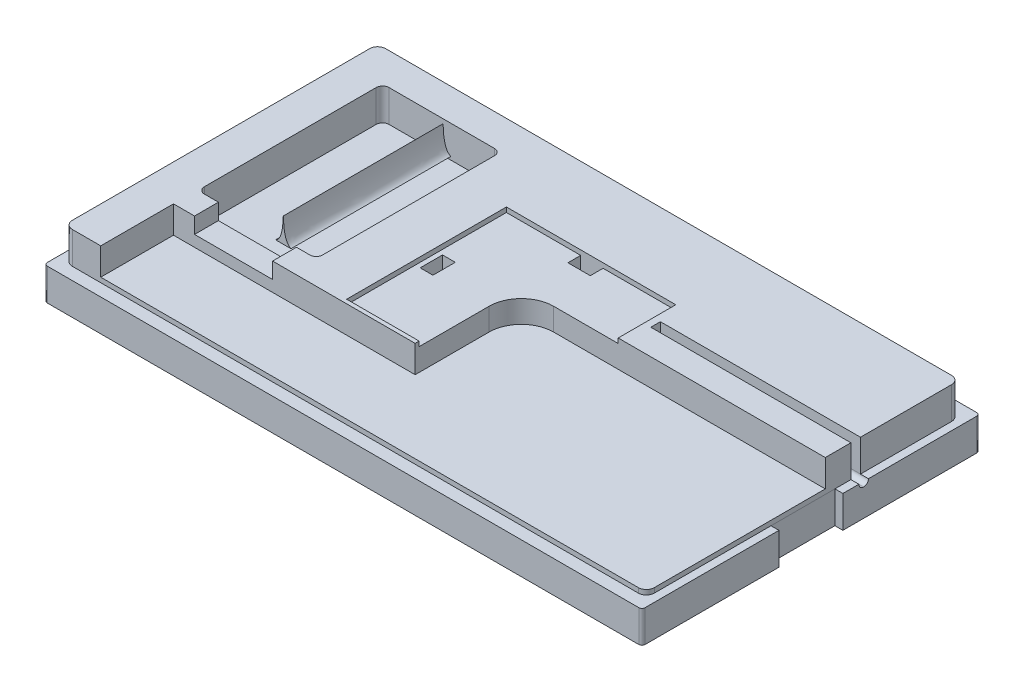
ISO-10303-21;
HEADER;
FILE_DESCRIPTION(('STEP AP214'),'2;1');
FILE_NAME('part.step','',(''),(''),'','','');
FILE_SCHEMA(('AUTOMOTIVE_DESIGN { 1 0 10303 214 1 1 1 1 }'));
ENDSEC;
DATA;
#1=APPLICATION_CONTEXT('core data for automotive mechanical design processes');
#2=APPLICATION_PROTOCOL_DEFINITION('international standard','automotive_design',2000,#1);
#3=PRODUCT_CONTEXT('',#1,'mechanical');
#4=PRODUCT('Part','Part','',(#3));
#5=PRODUCT_RELATED_PRODUCT_CATEGORY('part','',(#4));
#6=PRODUCT_DEFINITION_FORMATION('','',#4);
#7=PRODUCT_DEFINITION_CONTEXT('part definition',#1,'design');
#8=PRODUCT_DEFINITION('design','',#6,#7);
#9=PRODUCT_DEFINITION_SHAPE('','',#8);
#10=(LENGTH_UNIT() NAMED_UNIT(*) SI_UNIT(.MILLI.,.METRE.));
#11=(NAMED_UNIT(*) PLANE_ANGLE_UNIT() SI_UNIT($,.RADIAN.));
#12=(NAMED_UNIT(*) SI_UNIT($,.STERADIAN.) SOLID_ANGLE_UNIT());
#13=UNCERTAINTY_MEASURE_WITH_UNIT(LENGTH_MEASURE(1.E-05),#10,'distance_accuracy_value','');
#14=(GEOMETRIC_REPRESENTATION_CONTEXT(3) GLOBAL_UNCERTAINTY_ASSIGNED_CONTEXT((#13)) GLOBAL_UNIT_ASSIGNED_CONTEXT((#10,
#11,#12)) REPRESENTATION_CONTEXT('',''));
#15=CARTESIAN_POINT('',(0.,0.,0.));
#16=DIRECTION('',(0.,0.,1.));
#17=DIRECTION('',(1.,0.,0.));
#18=AXIS2_PLACEMENT_3D('',#15,#16,#17);
#19=CARTESIAN_POINT('',(-92.55,10.,-51.88));
#20=DIRECTION('',(0.,1.,0.));
#21=DIRECTION('',(0.,0.,1.));
#22=AXIS2_PLACEMENT_3D('',#19,#20,#21);
#23=PLANE('',#22);
#24=DIRECTION('',(0.,0.,-1.));
#25=VECTOR('',#24,1.);
#26=CARTESIAN_POINT('',(91.0602202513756,10.,-46.5159679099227));
#27=LINE('',#26,#25);
#28=CARTESIAN_POINT('',(91.0602202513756,10.,-18.));
#29=VERTEX_POINT('',#28);
#30=CARTESIAN_POINT('',(91.0602202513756,10.,-46.5159679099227));
#31=VERTEX_POINT('',#30);
#32=EDGE_CURVE('E617',#29,#31,#27,.T.);
#33=ORIENTED_EDGE('',*,*,#32,.F.);
#34=DIRECTION('',(1.,0.,0.));
#35=VECTOR('',#34,1.);
#36=CARTESIAN_POINT('',(-92.55,10.,-18.));
#37=LINE('',#36,#35);
#38=CARTESIAN_POINT('',(93.55,10.,-18.));
#39=VERTEX_POINT('',#38);
#40=EDGE_CURVE('E471',#29,#39,#37,.T.);
#41=ORIENTED_EDGE('',*,*,#40,.T.);
#42=DIRECTION('',(0.,0.,1.));
#43=VECTOR('',#42,1.);
#44=CARTESIAN_POINT('',(93.55,10.,-51.88));
#45=LINE('',#44,#43);
#46=CARTESIAN_POINT('',(93.55,10.,-51.88));
#47=VERTEX_POINT('',#46);
#48=EDGE_CURVE('E555',#47,#39,#45,.T.);
#49=ORIENTED_EDGE('',*,*,#48,.F.);
#50=CARTESIAN_POINT('',(92.55,10.,-51.88));
#51=DIRECTION('',(0.,-1.,0.));
#52=DIRECTION('',(0.,0.,-1.));
#53=AXIS2_PLACEMENT_3D('',#50,#51,#52);
#54=CIRCLE('',#53,0.999999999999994);
#55=CARTESIAN_POINT('',(92.55,10.,-52.88));
#56=VERTEX_POINT('',#55);
#57=EDGE_CURVE('E558',#56,#47,#54,.T.);
#58=ORIENTED_EDGE('',*,*,#57,.F.);
#59=DIRECTION('',(1.,0.,0.));
#60=VECTOR('',#59,1.);
#61=CARTESIAN_POINT('',(-92.55,10.,-52.88));
#62=LINE('',#61,#60);
#63=CARTESIAN_POINT('',(-92.55,10.,-52.88));
#64=VERTEX_POINT('',#63);
#65=EDGE_CURVE('E562',#64,#56,#62,.T.);
#66=ORIENTED_EDGE('',*,*,#65,.F.);
#67=CARTESIAN_POINT('',(-92.55,10.,-51.88));
#68=DIRECTION('',(0.,1.,0.));
#69=DIRECTION('',(0.,0.,1.));
#70=AXIS2_PLACEMENT_3D('',#67,#68,#69);
#71=CIRCLE('',#70,1.);
#72=CARTESIAN_POINT('',(-93.55,10.,-51.88));
#73=VERTEX_POINT('',#72);
#74=EDGE_CURVE('E539',#64,#73,#71,.T.);
#75=ORIENTED_EDGE('',*,*,#74,.T.);
#76=DIRECTION('',(0.,0.,1.));
#77=VECTOR('',#76,1.);
#78=CARTESIAN_POINT('',(-93.55,10.,-51.88));
#79=LINE('',#78,#77);
#80=CARTESIAN_POINT('',(-93.55,10.,-10.));
#81=VERTEX_POINT('',#80);
#82=EDGE_CURVE('E544',#73,#81,#79,.T.);
#83=ORIENTED_EDGE('',*,*,#82,.T.);
#84=DIRECTION('',(1.,0.,0.));
#85=VECTOR('',#84,1.);
#86=CARTESIAN_POINT('',(-93.55,10.,-10.));
#87=LINE('',#86,#85);
#88=CARTESIAN_POINT('',(-91.0602202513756,10.,-10.));
#89=VERTEX_POINT('',#88);
#90=EDGE_CURVE('E514',#81,#89,#87,.T.);
#91=ORIENTED_EDGE('',*,*,#90,.T.);
#92=DIRECTION('',(0.,0.,1.));
#93=VECTOR('',#92,1.);
#94=CARTESIAN_POINT('',(-91.0602202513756,10.,-46.5159679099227));
#95=LINE('',#94,#93);
#96=CARTESIAN_POINT('',(-91.0602202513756,10.,-46.5159679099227));
#97=VERTEX_POINT('',#96);
#98=EDGE_CURVE('E632',#97,#89,#95,.T.);
#99=ORIENTED_EDGE('',*,*,#98,.F.);
#100=CARTESIAN_POINT('',(-88.5602202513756,10.,-46.5159679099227));
#101=DIRECTION('',(0.,1.,0.));
#102=DIRECTION('',(0.,0.,1.));
#103=AXIS2_PLACEMENT_3D('',#100,#101,#102);
#104=CIRCLE('',#103,2.5);
#105=CARTESIAN_POINT('',(-88.5602202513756,10.,-49.0159679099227));
#106=VERTEX_POINT('',#105);
#107=EDGE_CURVE('E614',#106,#97,#104,.T.);
#108=ORIENTED_EDGE('',*,*,#107,.F.);
#109=DIRECTION('',(-1.,0.,0.));
#110=VECTOR('',#109,1.);
#111=CARTESIAN_POINT('',(-88.5602202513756,10.,-49.0159679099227));
#112=LINE('',#111,#110);
#113=CARTESIAN_POINT('',(88.5602202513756,10.,-49.0159679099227));
#114=VERTEX_POINT('',#113);
#115=EDGE_CURVE('E608',#114,#106,#112,.T.);
#116=ORIENTED_EDGE('',*,*,#115,.F.);
#117=CARTESIAN_POINT('',(88.5602202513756,10.,-46.5159679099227));
#118=DIRECTION('',(0.,1.,0.));
#119=DIRECTION('',(0.,0.,1.));
#120=AXIS2_PLACEMENT_3D('',#117,#118,#119);
#121=CIRCLE('',#120,2.50000000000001);
#122=EDGE_CURVE('E611',#31,#114,#121,.T.);
#123=ORIENTED_EDGE('',*,*,#122,.F.);
#124=EDGE_LOOP('',(#33,#41,#49,#58,#66,#75,#83,#91,#99,#108,#116,#123));
#125=FACE_BOUND('',#124,.T.);
#126=ADVANCED_FACE('F33',(#125),#23,.T.);
#127=CARTESIAN_POINT('',(93.55,10.,-51.88));
#128=DIRECTION('',(1.,0.,0.));
#129=DIRECTION('',(0.,0.,-1.));
#130=AXIS2_PLACEMENT_3D('',#127,#128,#129);
#131=PLANE('',#130);
#132=ORIENTED_EDGE('',*,*,#48,.T.);
#133=CARTESIAN_POINT('',(93.55,9.99999999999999,-16.5));
#134=DIRECTION('',(1.,0.,0.));
#135=DIRECTION('',(0.,0.,-1.));
#136=AXIS2_PLACEMENT_3D('',#133,#134,#135);
#137=CIRCLE('',#136,1.5);
#138=CARTESIAN_POINT('',(93.55,8.49999999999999,-16.5));
#139=VERTEX_POINT('',#138);
#140=EDGE_CURVE('E975',#39,#139,#137,.F.);
#141=ORIENTED_EDGE('',*,*,#140,.T.);
#142=CARTESIAN_POINT('',(93.55,9.99999999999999,-16.5));
#143=DIRECTION('',(1.,0.,0.));
#144=DIRECTION('',(0.,0.,-1.));
#145=AXIS2_PLACEMENT_3D('',#142,#143,#144);
#146=CIRCLE('',#145,1.5);
#147=CARTESIAN_POINT('',(93.55,10.,-15.));
#148=VERTEX_POINT('',#147);
#149=EDGE_CURVE('E11',#139,#148,#146,.F.);
#150=ORIENTED_EDGE('',*,*,#149,.T.);
#151=CARTESIAN_POINT('',(93.55,10.,-10.));
#152=VERTEX_POINT('',#151);
#153=EDGE_CURVE('E559',#148,#152,#45,.T.);
#154=ORIENTED_EDGE('',*,*,#153,.T.);
#155=DIRECTION('',(0.,-1.,0.));
#156=VECTOR('',#155,1.);
#157=CARTESIAN_POINT('',(93.55,10.,-10.));
#158=LINE('',#157,#156);
#159=CARTESIAN_POINT('',(93.55,0.,-10.));
#160=VERTEX_POINT('',#159);
#161=EDGE_CURVE('E497',#152,#160,#158,.T.);
#162=ORIENTED_EDGE('',*,*,#161,.T.);
#163=DIRECTION('',(0.,0.,1.));
#164=VECTOR('',#163,1.);
#165=CARTESIAN_POINT('',(93.55,0.,-51.88));
#166=LINE('',#165,#164);
#167=CARTESIAN_POINT('',(93.55,0.,-51.88));
#168=VERTEX_POINT('',#167);
#169=EDGE_CURVE('E580',#168,#160,#166,.T.);
#170=ORIENTED_EDGE('',*,*,#169,.F.);
#171=DIRECTION('',(0.,-1.,0.));
#172=VECTOR('',#171,1.);
#173=CARTESIAN_POINT('',(93.55,10.,-51.88));
#174=LINE('',#173,#172);
#175=EDGE_CURVE('E591',#47,#168,#174,.T.);
#176=ORIENTED_EDGE('',*,*,#175,.F.);
#177=EDGE_LOOP('',(#132,#141,#150,#154,#162,#170,#176));
#178=FACE_BOUND('',#177,.T.);
#179=ADVANCED_FACE('F846',(#178),#131,.T.);
#180=CARTESIAN_POINT('',(-88.5602202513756,20.,-46.5159679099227));
#181=DIRECTION('',(0.,1.,0.));
#182=DIRECTION('',(0.,0.,1.));
#183=AXIS2_PLACEMENT_3D('',#180,#181,#182);
#184=PLANE('',#183);
#185=DIRECTION('',(0.,0.,1.));
#186=VECTOR('',#185,1.);
#187=CARTESIAN_POINT('',(28.442112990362,20.,-18.));
#188=LINE('',#187,#186);
#189=CARTESIAN_POINT('',(28.442112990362,20.,-18.));
#190=VERTEX_POINT('',#189);
#191=CARTESIAN_POINT('',(28.442112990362,20.,-15.));
#192=VERTEX_POINT('',#191);
#193=EDGE_CURVE('E454',#190,#192,#188,.T.);
#194=ORIENTED_EDGE('',*,*,#193,.F.);
#195=DIRECTION('',(1.,0.,0.));
#196=VECTOR('',#195,1.);
#197=CARTESIAN_POINT('',(28.442112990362,20.,-18.));
#198=LINE('',#197,#196);
#199=CARTESIAN_POINT('',(91.0602202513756,20.,-18.));
#200=VERTEX_POINT('',#199);
#201=EDGE_CURVE('E451',#190,#200,#198,.T.);
#202=ORIENTED_EDGE('',*,*,#201,.T.);
#203=DIRECTION('',(0.,0.,-1.));
#204=VECTOR('',#203,1.);
#205=CARTESIAN_POINT('',(91.0602202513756,20.,-46.5159679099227));
#206=LINE('',#205,#204);
#207=CARTESIAN_POINT('',(91.0602202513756,20.,-46.5159679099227));
#208=VERTEX_POINT('',#207);
#209=EDGE_CURVE('E998',#200,#208,#206,.T.);
#210=ORIENTED_EDGE('',*,*,#209,.T.);
#211=CARTESIAN_POINT('',(88.5602202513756,20.,-46.5159679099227));
#212=DIRECTION('',(0.,1.,0.));
#213=DIRECTION('',(0.,0.,-1.));
#214=AXIS2_PLACEMENT_3D('',#211,#212,#213);
#215=CIRCLE('',#214,2.50000000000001);
#216=CARTESIAN_POINT('',(88.5602202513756,20.,-49.0159679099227));
#217=VERTEX_POINT('',#216);
#218=EDGE_CURVE('E992',#208,#217,#215,.T.);
#219=ORIENTED_EDGE('',*,*,#218,.T.);
#220=DIRECTION('',(-1.,0.,0.));
#221=VECTOR('',#220,1.);
#222=CARTESIAN_POINT('',(-88.5602202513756,20.,-49.0159679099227));
#223=LINE('',#222,#221);
#224=CARTESIAN_POINT('',(-88.5602202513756,20.,-49.0159679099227));
#225=VERTEX_POINT('',#224);
#226=EDGE_CURVE('E994',#217,#225,#223,.T.);
#227=ORIENTED_EDGE('',*,*,#226,.T.);
#228=CARTESIAN_POINT('',(-88.5602202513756,20.,-46.5159679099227));
#229=DIRECTION('',(0.,1.,0.));
#230=DIRECTION('',(0.,0.,1.));
#231=AXIS2_PLACEMENT_3D('',#228,#229,#230);
#232=CIRCLE('',#231,2.5);
#233=CARTESIAN_POINT('',(-91.0602202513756,20.,-46.5159679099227));
#234=VERTEX_POINT('',#233);
#235=EDGE_CURVE('E1006',#225,#234,#232,.T.);
#236=ORIENTED_EDGE('',*,*,#235,.T.);
#237=DIRECTION('',(0.,0.,1.));
#238=VECTOR('',#237,1.);
#239=CARTESIAN_POINT('',(-91.0602202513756,20.,-46.5159679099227));
#240=LINE('',#239,#238);
#241=CARTESIAN_POINT('',(-91.0602202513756,20.,46.5159679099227));
#242=VERTEX_POINT('',#241);
#243=EDGE_CURVE('E1008',#234,#242,#240,.T.);
#244=ORIENTED_EDGE('',*,*,#243,.T.);
#245=CARTESIAN_POINT('',(-88.5602202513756,20.,46.5159679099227));
#246=DIRECTION('',(0.,1.,0.));
#247=DIRECTION('',(0.,0.,1.));
#248=AXIS2_PLACEMENT_3D('',#245,#246,#247);
#249=CIRCLE('',#248,2.5);
#250=CARTESIAN_POINT('',(-88.5602202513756,20.,49.0159679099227));
#251=VERTEX_POINT('',#250);
#252=EDGE_CURVE('E1013',#242,#251,#249,.T.);
#253=ORIENTED_EDGE('',*,*,#252,.T.);
#254=DIRECTION('',(1.,0.,0.));
#255=VECTOR('',#254,1.);
#256=CARTESIAN_POINT('',(-88.5602202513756,20.,49.0159679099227));
#257=LINE('',#256,#255);
#258=CARTESIAN_POINT('',(-79.694383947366,20.,49.0159679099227));
#259=VERTEX_POINT('',#258);
#260=EDGE_CURVE('E1015',#251,#259,#257,.T.);
#261=ORIENTED_EDGE('',*,*,#260,.T.);
#262=DIRECTION('',(0.,0.,1.));
#263=VECTOR('',#262,1.);
#264=CARTESIAN_POINT('',(-79.694383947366,20.,26.25));
#265=LINE('',#264,#263);
#266=CARTESIAN_POINT('',(-79.694383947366,20.,26.25));
#267=VERTEX_POINT('',#266);
#268=EDGE_CURVE('E752',#267,#259,#265,.T.);
#269=ORIENTED_EDGE('',*,*,#268,.F.);
#270=DIRECTION('',(1.,0.,0.));
#271=VECTOR('',#270,1.);
#272=CARTESIAN_POINT('',(-79.694383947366,20.,26.25));
#273=LINE('',#272,#271);
#274=CARTESIAN_POINT('',(-73.1104396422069,20.,26.25));
#275=VERTEX_POINT('',#274);
#276=EDGE_CURVE('E756',#267,#275,#273,.T.);
#277=ORIENTED_EDGE('',*,*,#276,.T.);
#278=DIRECTION('',(0.,0.,1.));
#279=VECTOR('',#278,1.);
#280=CARTESIAN_POINT('',(-73.1104396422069,20.,17.3282868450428));
#281=LINE('',#280,#279);
#282=CARTESIAN_POINT('',(-73.1104396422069,20.,18.7707739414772));
#283=VERTEX_POINT('',#282);
#284=EDGE_CURVE('E736',#283,#275,#281,.T.);
#285=ORIENTED_EDGE('',*,*,#284,.F.);
#286=DIRECTION('',(1.,0.,0.));
#287=VECTOR('',#286,1.);
#288=CARTESIAN_POINT('',(-77.5,20.,18.7707739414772));
#289=LINE('',#288,#287);
#290=CARTESIAN_POINT('',(-77.5,20.,18.7707739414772));
#291=VERTEX_POINT('',#290);
#292=EDGE_CURVE('E1274',#291,#283,#289,.T.);
#293=ORIENTED_EDGE('',*,*,#292,.F.);
#294=CARTESIAN_POINT('',(-77.5,20.,16.7707739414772));
#295=DIRECTION('',(0.,1.,0.));
#296=DIRECTION('',(0.,0.,1.));
#297=AXIS2_PLACEMENT_3D('',#294,#295,#296);
#298=CIRCLE('',#297,1.99999999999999);
#299=CARTESIAN_POINT('',(-79.5,20.,16.7707739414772));
#300=VERTEX_POINT('',#299);
#301=EDGE_CURVE('E1277',#300,#291,#298,.T.);
#302=ORIENTED_EDGE('',*,*,#301,.F.);
#303=DIRECTION('',(0.,0.,1.));
#304=VECTOR('',#303,1.);
#305=CARTESIAN_POINT('',(-79.5,20.,-37.));
#306=LINE('',#305,#304);
#307=CARTESIAN_POINT('',(-79.5,20.,-37.));
#308=VERTEX_POINT('',#307);
#309=EDGE_CURVE('E1240',#308,#300,#306,.T.);
#310=ORIENTED_EDGE('',*,*,#309,.F.);
#311=CARTESIAN_POINT('',(-77.5,20.,-37.));
#312=DIRECTION('',(0.,-1.,0.));
#313=DIRECTION('',(0.,0.,-1.));
#314=AXIS2_PLACEMENT_3D('',#311,#312,#313);
#315=CIRCLE('',#314,1.99999999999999);
#316=CARTESIAN_POINT('',(-77.5,20.,-39.));
#317=VERTEX_POINT('',#316);
#318=EDGE_CURVE('E1232',#308,#317,#315,.T.);
#319=ORIENTED_EDGE('',*,*,#318,.T.);
#320=DIRECTION('',(1.,0.,0.));
#321=VECTOR('',#320,1.);
#322=CARTESIAN_POINT('',(-77.5,20.,-39.));
#323=LINE('',#322,#321);
#324=CARTESIAN_POINT('',(-44.5,20.,-39.));
#325=VERTEX_POINT('',#324);
#326=EDGE_CURVE('E1261',#317,#325,#323,.T.);
#327=ORIENTED_EDGE('',*,*,#326,.T.);
#328=CARTESIAN_POINT('',(-44.5,20.,-37.));
#329=DIRECTION('',(0.,-1.,0.));
#330=DIRECTION('',(0.,0.,-1.));
#331=AXIS2_PLACEMENT_3D('',#328,#329,#330);
#332=CIRCLE('',#331,2.00000000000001);
#333=CARTESIAN_POINT('',(-42.5,20.,-37.));
#334=VERTEX_POINT('',#333);
#335=EDGE_CURVE('E1264',#325,#334,#332,.T.);
#336=ORIENTED_EDGE('',*,*,#335,.T.);
#337=DIRECTION('',(0.,0.,1.));
#338=VECTOR('',#337,1.);
#339=CARTESIAN_POINT('',(-42.5,20.,-37.));
#340=LINE('',#339,#338);
#341=CARTESIAN_POINT('',(-42.5,20.,16.7707739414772));
#342=VERTEX_POINT('',#341);
#343=EDGE_CURVE('E1267',#334,#342,#340,.T.);
#344=ORIENTED_EDGE('',*,*,#343,.T.);
#345=CARTESIAN_POINT('',(-44.5,20.,16.7707739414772));
#346=DIRECTION('',(0.,1.,0.));
#347=DIRECTION('',(0.,0.,1.));
#348=AXIS2_PLACEMENT_3D('',#345,#346,#347);
#349=CIRCLE('',#348,2.);
#350=CARTESIAN_POINT('',(-44.5,20.,18.7707739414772));
#351=VERTEX_POINT('',#350);
#352=EDGE_CURVE('E1270',#351,#342,#349,.T.);
#353=ORIENTED_EDGE('',*,*,#352,.F.);
#354=CARTESIAN_POINT('',(-48.6853527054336,20.,18.7707739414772));
#355=VERTEX_POINT('',#354);
#356=EDGE_CURVE('E1273',#355,#351,#289,.T.);
#357=ORIENTED_EDGE('',*,*,#356,.F.);
#358=DIRECTION('',(0.,0.,-1.));
#359=VECTOR('',#358,1.);
#360=CARTESIAN_POINT('',(-48.6853527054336,20.,17.3282868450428));
#361=LINE('',#360,#359);
#362=CARTESIAN_POINT('',(-48.6853527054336,20.,26.25));
#363=VERTEX_POINT('',#362);
#364=EDGE_CURVE('E731',#363,#355,#361,.T.);
#365=ORIENTED_EDGE('',*,*,#364,.F.);
#366=CARTESIAN_POINT('',(-4.0556096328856,20.,26.25));
#367=VERTEX_POINT('',#366);
#368=EDGE_CURVE('E748',#363,#367,#273,.T.);
#369=ORIENTED_EDGE('',*,*,#368,.T.);
#370=DIRECTION('',(0.,0.,1.));
#371=VECTOR('',#370,1.);
#372=CARTESIAN_POINT('',(-4.0556096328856,20.,3.13179779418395));
#373=LINE('',#372,#371);
#374=CARTESIAN_POINT('',(-4.0556096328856,20.,25.));
#375=VERTEX_POINT('',#374);
#376=EDGE_CURVE('E1300',#375,#367,#373,.T.);
#377=ORIENTED_EDGE('',*,*,#376,.F.);
#378=DIRECTION('',(1.,0.,0.));
#379=VECTOR('',#378,1.);
#380=CARTESIAN_POINT('',(-26.7491169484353,20.,25.));
#381=LINE('',#380,#379);
#382=CARTESIAN_POINT('',(-26.7491169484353,20.,25.));
#383=VERTEX_POINT('',#382);
#384=EDGE_CURVE('E639',#383,#375,#381,.T.);
#385=ORIENTED_EDGE('',*,*,#384,.F.);
#386=DIRECTION('',(0.,0.,1.));
#387=VECTOR('',#386,1.);
#388=CARTESIAN_POINT('',(-26.7491169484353,20.,-25.));
#389=LINE('',#388,#387);
#390=CARTESIAN_POINT('',(-26.7491169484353,20.,-25.));
#391=VERTEX_POINT('',#390);
#392=EDGE_CURVE('E651',#391,#383,#389,.T.);
#393=ORIENTED_EDGE('',*,*,#392,.F.);
#394=DIRECTION('',(1.,0.,0.));
#395=VECTOR('',#394,1.);
#396=CARTESIAN_POINT('',(-3.5,20.,-25.));
#397=LINE('',#396,#395);
#398=CARTESIAN_POINT('',(26.2508830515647,20.,-25.));
#399=VERTEX_POINT('',#398);
#400=EDGE_CURVE('E706',#391,#399,#397,.T.);
#401=ORIENTED_EDGE('',*,*,#400,.T.);
#402=DIRECTION('',(0.,0.,-1.));
#403=VECTOR('',#402,1.);
#404=CARTESIAN_POINT('',(26.2508830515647,20.,-25.));
#405=LINE('',#404,#403);
#406=CARTESIAN_POINT('',(26.2508830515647,20.,-6.98403209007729));
#407=VERTEX_POINT('',#406);
#408=EDGE_CURVE('E635',#407,#399,#405,.T.);
#409=ORIENTED_EDGE('',*,*,#408,.F.);
#410=DIRECTION('',(1.,0.,0.));
#411=VECTOR('',#410,1.);
#412=CARTESIAN_POINT('',(6.06022025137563,20.,-6.98403209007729));
#413=LINE('',#412,#411);
#414=CARTESIAN_POINT('',(91.0602202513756,20.,-6.98403209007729));
#415=VERTEX_POINT('',#414);
#416=EDGE_CURVE('E1305',#407,#415,#413,.T.);
#417=ORIENTED_EDGE('',*,*,#416,.T.);
#418=CARTESIAN_POINT('',(91.0602202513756,20.,-15.));
#419=VERTEX_POINT('',#418);
#420=EDGE_CURVE('E464',#415,#419,#206,.T.);
#421=ORIENTED_EDGE('',*,*,#420,.T.);
#422=DIRECTION('',(1.,0.,0.));
#423=VECTOR('',#422,1.);
#424=CARTESIAN_POINT('',(28.442112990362,20.,-15.));
#425=LINE('',#424,#423);
#426=EDGE_CURVE('E446',#192,#419,#425,.T.);
#427=ORIENTED_EDGE('',*,*,#426,.F.);
#428=EDGE_LOOP('',(#194,#202,#210,#219,#227,#236,#244,#253,#261,#269,#277,#285,#293,#302,#310,
#319,#327,#336,#344,#353,#357,#365,#369,#377,#385,#393,#401,#409,#417,#421,#427));
#429=FACE_BOUND('',#428,.T.);
#430=ADVANCED_FACE('F462',(#429),#184,.T.);
#431=CARTESIAN_POINT('',(91.0602202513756,20.,-46.5159679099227));
#432=DIRECTION('',(-1.,0.,0.));
#433=DIRECTION('',(0.,0.,1.));
#434=AXIS2_PLACEMENT_3D('',#431,#432,#433);
#435=PLANE('',#434);
#436=DIRECTION('',(0.,1.,0.));
#437=VECTOR('',#436,1.);
#438=CARTESIAN_POINT('',(91.0602202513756,20.,-18.));
#439=LINE('',#438,#437);
#440=EDGE_CURVE('E966',#29,#200,#439,.T.);
#441=ORIENTED_EDGE('',*,*,#440,.F.);
#442=ORIENTED_EDGE('',*,*,#32,.T.);
#443=DIRECTION('',(0.,-1.,0.));
#444=VECTOR('',#443,1.);
#445=CARTESIAN_POINT('',(91.0602202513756,20.,-46.5159679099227));
#446=LINE('',#445,#444);
#447=EDGE_CURVE('E928',#208,#31,#446,.T.);
#448=ORIENTED_EDGE('',*,*,#447,.F.);
#449=ORIENTED_EDGE('',*,*,#209,.F.);
#450=EDGE_LOOP('',(#441,#442,#448,#449));
#451=FACE_BOUND('',#450,.T.);
#452=ADVANCED_FACE('F845',(#451),#435,.F.);
#453=DIRECTION('',(1.,0.,0.));
#454=VECTOR('',#453,1.);
#455=CARTESIAN_POINT('',(-92.55,10.,-15.));
#456=LINE('',#455,#454);
#457=CARTESIAN_POINT('',(91.0602202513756,10.,-15.));
#458=VERTEX_POINT('',#457);
#459=EDGE_CURVE('E468',#458,#148,#456,.T.);
#460=ORIENTED_EDGE('',*,*,#459,.F.);
#461=CARTESIAN_POINT('',(91.0602202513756,10.,-10.));
#462=VERTEX_POINT('',#461);
#463=EDGE_CURVE('E622',#462,#458,#27,.T.);
#464=ORIENTED_EDGE('',*,*,#463,.F.);
#465=DIRECTION('',(-1.,0.,0.));
#466=VECTOR('',#465,1.);
#467=CARTESIAN_POINT('',(93.55,10.,-10.));
#468=LINE('',#467,#466);
#469=EDGE_CURVE('E479',#152,#462,#468,.T.);
#470=ORIENTED_EDGE('',*,*,#469,.F.);
#471=ORIENTED_EDGE('',*,*,#153,.F.);
#472=EDGE_LOOP('',(#460,#464,#470,#471));
#473=FACE_BOUND('',#472,.T.);
#474=ADVANCED_FACE('F893',(#473),#23,.T.);
#475=DIRECTION('',(-1.,0.,0.));
#476=VECTOR('',#475,1.);
#477=CARTESIAN_POINT('',(93.55,10.,10.));
#478=LINE('',#477,#476);
#479=CARTESIAN_POINT('',(93.55,10.,10.));
#480=VERTEX_POINT('',#479);
#481=CARTESIAN_POINT('',(91.0602202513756,10.,10.));
#482=VERTEX_POINT('',#481);
#483=EDGE_CURVE('E474',#480,#482,#478,.T.);
#484=ORIENTED_EDGE('',*,*,#483,.T.);
#485=CARTESIAN_POINT('',(91.0602202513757,10.,46.5159679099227));
#486=VERTEX_POINT('',#485);
#487=EDGE_CURVE('E618',#486,#482,#27,.T.);
#488=ORIENTED_EDGE('',*,*,#487,.F.);
#489=CARTESIAN_POINT('',(88.5602202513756,10.,46.5159679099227));
#490=DIRECTION('',(0.,1.,0.));
#491=DIRECTION('',(0.,0.,1.));
#492=AXIS2_PLACEMENT_3D('',#489,#490,#491);
#493=CIRCLE('',#492,2.50000000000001);
#494=CARTESIAN_POINT('',(88.5602202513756,10.,49.0159679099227));
#495=VERTEX_POINT('',#494);
#496=EDGE_CURVE('E621',#495,#486,#493,.T.);
#497=ORIENTED_EDGE('',*,*,#496,.F.);
#498=DIRECTION('',(1.,0.,0.));
#499=VECTOR('',#498,1.);
#500=CARTESIAN_POINT('',(-88.5602202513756,10.,49.0159679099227));
#501=LINE('',#500,#499);
#502=CARTESIAN_POINT('',(-88.5602202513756,10.,49.0159679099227));
#503=VERTEX_POINT('',#502);
#504=EDGE_CURVE('E625',#503,#495,#501,.T.);
#505=ORIENTED_EDGE('',*,*,#504,.F.);
#506=CARTESIAN_POINT('',(-88.5602202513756,10.,46.5159679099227));
#507=DIRECTION('',(0.,1.,0.));
#508=DIRECTION('',(0.,0.,1.));
#509=AXIS2_PLACEMENT_3D('',#506,#507,#508);
#510=CIRCLE('',#509,2.5);
#511=CARTESIAN_POINT('',(-91.0602202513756,10.,46.5159679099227));
#512=VERTEX_POINT('',#511);
#513=EDGE_CURVE('E628',#512,#503,#510,.T.);
#514=ORIENTED_EDGE('',*,*,#513,.F.);
#515=CARTESIAN_POINT('',(-91.0602202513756,10.,10.));
#516=VERTEX_POINT('',#515);
#517=EDGE_CURVE('E631',#516,#512,#95,.T.);
#518=ORIENTED_EDGE('',*,*,#517,.F.);
#519=DIRECTION('',(1.,0.,0.));
#520=VECTOR('',#519,1.);
#521=CARTESIAN_POINT('',(-93.55,10.,10.));
#522=LINE('',#521,#520);
#523=CARTESIAN_POINT('',(-93.55,10.,10.));
#524=VERTEX_POINT('',#523);
#525=EDGE_CURVE('E506',#524,#516,#522,.T.);
#526=ORIENTED_EDGE('',*,*,#525,.F.);
#527=CARTESIAN_POINT('',(-93.55,10.,51.88));
#528=VERTEX_POINT('',#527);
#529=EDGE_CURVE('E542',#524,#528,#79,.T.);
#530=ORIENTED_EDGE('',*,*,#529,.T.);
#531=CARTESIAN_POINT('',(-92.55,10.,51.88));
#532=DIRECTION('',(0.,1.,0.));
#533=DIRECTION('',(0.,0.,1.));
#534=AXIS2_PLACEMENT_3D('',#531,#532,#533);
#535=CIRCLE('',#534,1.);
#536=CARTESIAN_POINT('',(-92.55,10.,52.88));
#537=VERTEX_POINT('',#536);
#538=EDGE_CURVE('E547',#528,#537,#535,.T.);
#539=ORIENTED_EDGE('',*,*,#538,.T.);
#540=DIRECTION('',(1.,0.,0.));
#541=VECTOR('',#540,1.);
#542=CARTESIAN_POINT('',(-92.55,10.,52.88));
#543=LINE('',#542,#541);
#544=CARTESIAN_POINT('',(92.55,10.,52.88));
#545=VERTEX_POINT('',#544);
#546=EDGE_CURVE('E549',#537,#545,#543,.T.);
#547=ORIENTED_EDGE('',*,*,#546,.T.);
#548=CARTESIAN_POINT('',(92.55,10.,51.88));
#549=DIRECTION('',(0.,1.,0.));
#550=DIRECTION('',(0.,0.,1.));
#551=AXIS2_PLACEMENT_3D('',#548,#549,#550);
#552=CIRCLE('',#551,1.);
#553=CARTESIAN_POINT('',(93.55,10.,51.88));
#554=VERTEX_POINT('',#553);
#555=EDGE_CURVE('E551',#545,#554,#552,.T.);
#556=ORIENTED_EDGE('',*,*,#555,.T.);
#557=EDGE_CURVE('E554',#480,#554,#45,.T.);
#558=ORIENTED_EDGE('',*,*,#557,.F.);
#559=EDGE_LOOP('',(#484,#488,#497,#505,#514,#518,#526,#530,#539,#547,#556,#558));
#560=FACE_BOUND('',#559,.T.);
#561=ADVANCED_FACE('F894',(#560),#23,.T.);
#562=CARTESIAN_POINT('',(-93.55,10.,-51.88));
#563=DIRECTION('',(1.,0.,0.));
#564=DIRECTION('',(0.,0.,-1.));
#565=AXIS2_PLACEMENT_3D('',#562,#563,#564);
#566=PLANE('',#565);
#567=DIRECTION('',(0.,-1.,0.));
#568=VECTOR('',#567,1.);
#569=CARTESIAN_POINT('',(-93.55,10.,10.));
#570=LINE('',#569,#568);
#571=CARTESIAN_POINT('',(-93.55,0.,10.));
#572=VERTEX_POINT('',#571);
#573=EDGE_CURVE('E517',#524,#572,#570,.T.);
#574=ORIENTED_EDGE('',*,*,#573,.T.);
#575=DIRECTION('',(0.,0.,1.));
#576=VECTOR('',#575,1.);
#577=CARTESIAN_POINT('',(-93.55,0.,-51.88));
#578=LINE('',#577,#576);
#579=CARTESIAN_POINT('',(-93.55,0.,51.88));
#580=VERTEX_POINT('',#579);
#581=EDGE_CURVE('E568',#572,#580,#578,.T.);
#582=ORIENTED_EDGE('',*,*,#581,.T.);
#583=DIRECTION('',(0.,-1.,0.));
#584=VECTOR('',#583,1.);
#585=CARTESIAN_POINT('',(-93.55,10.,51.88));
#586=LINE('',#585,#584);
#587=EDGE_CURVE('E602',#528,#580,#586,.T.);
#588=ORIENTED_EDGE('',*,*,#587,.F.);
#589=ORIENTED_EDGE('',*,*,#529,.F.);
#590=EDGE_LOOP('',(#574,#582,#588,#589));
#591=FACE_BOUND('',#590,.T.);
#592=ADVANCED_FACE('F849',(#591),#566,.F.);
#593=CARTESIAN_POINT('',(-88.5602202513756,0.,-46.5159679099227));
#594=DIRECTION('',(0.,1.,0.));
#595=DIRECTION('',(0.,0.,1.));
#596=AXIS2_PLACEMENT_3D('',#593,#594,#595);
#597=PLANE('',#596);
#598=DIRECTION('',(0.,0.,-1.));
#599=VECTOR('',#598,1.);
#600=CARTESIAN_POINT('',(91.05,0.,10.));
#601=LINE('',#600,#599);
#602=CARTESIAN_POINT('',(91.05,0.,10.));
#603=VERTEX_POINT('',#602);
#604=CARTESIAN_POINT('',(91.05,0.,-10.));
#605=VERTEX_POINT('',#604);
#606=EDGE_CURVE('E491',#603,#605,#601,.T.);
#607=ORIENTED_EDGE('',*,*,#606,.F.);
#608=DIRECTION('',(-1.,0.,0.));
#609=VECTOR('',#608,1.);
#610=CARTESIAN_POINT('',(93.55,0.,10.));
#611=LINE('',#610,#609);
#612=CARTESIAN_POINT('',(93.55,0.,10.));
#613=VERTEX_POINT('',#612);
#614=EDGE_CURVE('E473',#613,#603,#611,.T.);
#615=ORIENTED_EDGE('',*,*,#614,.F.);
#616=CARTESIAN_POINT('',(93.55,0.,51.88));
#617=VERTEX_POINT('',#616);
#618=EDGE_CURVE('E579',#613,#617,#166,.T.);
#619=ORIENTED_EDGE('',*,*,#618,.T.);
#620=CARTESIAN_POINT('',(92.55,0.,51.88));
#621=DIRECTION('',(0.,1.,0.));
#622=DIRECTION('',(0.,0.,1.));
#623=AXIS2_PLACEMENT_3D('',#620,#621,#622);
#624=CIRCLE('',#623,1.);
#625=CARTESIAN_POINT('',(92.55,0.,52.88));
#626=VERTEX_POINT('',#625);
#627=EDGE_CURVE('E576',#626,#617,#624,.T.);
#628=ORIENTED_EDGE('',*,*,#627,.F.);
#629=DIRECTION('',(1.,0.,0.));
#630=VECTOR('',#629,1.);
#631=CARTESIAN_POINT('',(-92.55,0.,52.88));
#632=LINE('',#631,#630);
#633=CARTESIAN_POINT('',(-92.55,0.,52.88));
#634=VERTEX_POINT('',#633);
#635=EDGE_CURVE('E574',#634,#626,#632,.T.);
#636=ORIENTED_EDGE('',*,*,#635,.F.);
#637=CARTESIAN_POINT('',(-92.55,0.,51.88));
#638=DIRECTION('',(0.,1.,0.));
#639=DIRECTION('',(0.,0.,1.));
#640=AXIS2_PLACEMENT_3D('',#637,#638,#639);
#641=CIRCLE('',#640,1.);
#642=EDGE_CURVE('E572',#580,#634,#641,.T.);
#643=ORIENTED_EDGE('',*,*,#642,.F.);
#644=ORIENTED_EDGE('',*,*,#581,.F.);
#645=DIRECTION('',(1.,0.,0.));
#646=VECTOR('',#645,1.);
#647=CARTESIAN_POINT('',(-93.55,0.,10.));
#648=LINE('',#647,#646);
#649=CARTESIAN_POINT('',(-91.05,0.,10.));
#650=VERTEX_POINT('',#649);
#651=EDGE_CURVE('E505',#572,#650,#648,.T.);
#652=ORIENTED_EDGE('',*,*,#651,.T.);
#653=DIRECTION('',(0.,0.,-1.));
#654=VECTOR('',#653,1.);
#655=CARTESIAN_POINT('',(-91.05,0.,10.));
#656=LINE('',#655,#654);
#657=CARTESIAN_POINT('',(-91.05,0.,-10.));
#658=VERTEX_POINT('',#657);
#659=EDGE_CURVE('E520',#650,#658,#656,.T.);
#660=ORIENTED_EDGE('',*,*,#659,.T.);
#661=DIRECTION('',(1.,0.,0.));
#662=VECTOR('',#661,1.);
#663=CARTESIAN_POINT('',(-93.55,0.,-10.));
#664=LINE('',#663,#662);
#665=CARTESIAN_POINT('',(-93.55,0.,-9.99999999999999));
#666=VERTEX_POINT('',#665);
#667=EDGE_CURVE('E523',#666,#658,#664,.T.);
#668=ORIENTED_EDGE('',*,*,#667,.F.);
#669=CARTESIAN_POINT('',(-93.55,0.,-51.88));
#670=VERTEX_POINT('',#669);
#671=EDGE_CURVE('E569',#670,#666,#578,.T.);
#672=ORIENTED_EDGE('',*,*,#671,.F.);
#673=CARTESIAN_POINT('',(-92.55,0.,-51.88));
#674=DIRECTION('',(0.,1.,0.));
#675=DIRECTION('',(0.,0.,1.));
#676=AXIS2_PLACEMENT_3D('',#673,#674,#675);
#677=CIRCLE('',#676,1.);
#678=CARTESIAN_POINT('',(-92.55,0.,-52.88));
#679=VERTEX_POINT('',#678);
#680=EDGE_CURVE('E538',#679,#670,#677,.T.);
#681=ORIENTED_EDGE('',*,*,#680,.F.);
#682=DIRECTION('',(1.,0.,0.));
#683=VECTOR('',#682,1.);
#684=CARTESIAN_POINT('',(-92.55,0.,-52.88));
#685=LINE('',#684,#683);
#686=CARTESIAN_POINT('',(92.55,0.,-52.88));
#687=VERTEX_POINT('',#686);
#688=EDGE_CURVE('E543',#679,#687,#685,.T.);
#689=ORIENTED_EDGE('',*,*,#688,.T.);
#690=CARTESIAN_POINT('',(92.55,0.,-51.88));
#691=DIRECTION('',(0.,-1.,0.));
#692=DIRECTION('',(0.,0.,-1.));
#693=AXIS2_PLACEMENT_3D('',#690,#691,#692);
#694=CIRCLE('',#693,0.999999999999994);
#695=EDGE_CURVE('E583',#687,#168,#694,.T.);
#696=ORIENTED_EDGE('',*,*,#695,.T.);
#697=ORIENTED_EDGE('',*,*,#169,.T.);
#698=DIRECTION('',(-1.,0.,0.));
#699=VECTOR('',#698,1.);
#700=CARTESIAN_POINT('',(93.55,0.,-10.));
#701=LINE('',#700,#699);
#702=EDGE_CURVE('E488',#160,#605,#701,.T.);
#703=ORIENTED_EDGE('',*,*,#702,.T.);
#704=EDGE_LOOP('',(#607,#615,#619,#628,#636,#643,#644,#652,#660,#668,#672,#681,#689,#696,#697,#703));
#705=FACE_BOUND('',#704,.T.);
#706=ADVANCED_FACE('F841',(#705),#597,.F.);
#707=CARTESIAN_POINT('',(6.06022025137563,11.5,3.13179779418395));
#708=DIRECTION('',(0.,1.,0.));
#709=DIRECTION('',(0.,0.,1.));
#710=AXIS2_PLACEMENT_3D('',#707,#708,#709);
#711=CYLINDRICAL_SURFACE('',#710,10.1158298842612);
#712=CARTESIAN_POINT('',(6.06022025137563,18.5,3.13179779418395));
#713=DIRECTION('',(0.,1.,0.));
#714=DIRECTION('',(0.,0.,1.));
#715=AXIS2_PLACEMENT_3D('',#712,#713,#714);
#716=CIRCLE('',#715,10.1158298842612);
#717=CARTESIAN_POINT('',(-4.0556096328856,18.5,3.13179779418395));
#718=VERTEX_POINT('',#717);
#719=CARTESIAN_POINT('',(6.06022025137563,18.5,-6.98403209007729));
#720=VERTEX_POINT('',#719);
#721=EDGE_CURVE('E680',#718,#720,#716,.F.);
#722=ORIENTED_EDGE('',*,*,#721,.F.);
#723=DIRECTION('',(0.,1.,0.));
#724=VECTOR('',#723,1.);
#725=CARTESIAN_POINT('',(-4.0556096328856,11.5,3.13179779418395));
#726=LINE('',#725,#724);
#727=CARTESIAN_POINT('',(-4.0556096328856,11.5,3.13179779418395));
#728=VERTEX_POINT('',#727);
#729=EDGE_CURVE('E1313',#728,#718,#726,.T.);
#730=ORIENTED_EDGE('',*,*,#729,.F.);
#731=CARTESIAN_POINT('',(6.06022025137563,11.5,3.13179779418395));
#732=DIRECTION('',(0.,1.,0.));
#733=DIRECTION('',(0.,0.,1.));
#734=AXIS2_PLACEMENT_3D('',#731,#732,#733);
#735=CIRCLE('',#734,10.1158298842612);
#736=CARTESIAN_POINT('',(6.06022025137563,11.5,-6.98403209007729));
#737=VERTEX_POINT('',#736);
#738=EDGE_CURVE('E1301',#737,#728,#735,.T.);
#739=ORIENTED_EDGE('',*,*,#738,.F.);
#740=DIRECTION('',(0.,1.,0.));
#741=VECTOR('',#740,1.);
#742=CARTESIAN_POINT('',(6.06022025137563,11.5,-6.98403209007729));
#743=LINE('',#742,#741);
#744=EDGE_CURVE('E1316',#737,#720,#743,.T.);
#745=ORIENTED_EDGE('',*,*,#744,.T.);
#746=EDGE_LOOP('',(#722,#730,#739,#745));
#747=FACE_BOUND('',#746,.T.);
#748=ADVANCED_FACE('F837',(#747),#711,.F.);
#749=CARTESIAN_POINT('',(-3.5,12.,-21.));
#750=DIRECTION('',(1.,0.,0.));
#751=DIRECTION('',(0.,0.,-1.));
#752=AXIS2_PLACEMENT_3D('',#749,#750,#751);
#753=PLANE('',#752);
#754=DIRECTION('',(0.,1.,0.));
#755=VECTOR('',#754,1.);
#756=CARTESIAN_POINT('',(-3.5,12.,-25.));
#757=LINE('',#756,#755);
#758=CARTESIAN_POINT('',(-3.5,12.,-25.));
#759=VERTEX_POINT('',#758);
#760=CARTESIAN_POINT('',(-3.5,18.5,-25.));
#761=VERTEX_POINT('',#760);
#762=EDGE_CURVE('E728',#759,#761,#757,.T.);
#763=ORIENTED_EDGE('',*,*,#762,.T.);
#764=DIRECTION('',(0.,0.,1.));
#765=VECTOR('',#764,1.);
#766=CARTESIAN_POINT('',(-3.5,18.5,-21.));
#767=LINE('',#766,#765);
#768=CARTESIAN_POINT('',(-3.5,18.5,-21.));
#769=VERTEX_POINT('',#768);
#770=EDGE_CURVE('E674',#761,#769,#767,.T.);
#771=ORIENTED_EDGE('',*,*,#770,.T.);
#772=DIRECTION('',(0.,1.,0.));
#773=VECTOR('',#772,1.);
#774=CARTESIAN_POINT('',(-3.5,12.,-21.));
#775=LINE('',#774,#773);
#776=CARTESIAN_POINT('',(-3.5,12.,-21.));
#777=VERTEX_POINT('',#776);
#778=EDGE_CURVE('E718',#777,#769,#775,.T.);
#779=ORIENTED_EDGE('',*,*,#778,.F.);
#780=DIRECTION('',(0.,0.,-1.));
#781=VECTOR('',#780,1.);
#782=CARTESIAN_POINT('',(-3.5,12.,-21.));
#783=LINE('',#782,#781);
#784=EDGE_CURVE('E707',#777,#759,#783,.T.);
#785=ORIENTED_EDGE('',*,*,#784,.T.);
#786=EDGE_LOOP('',(#763,#771,#779,#785));
#787=FACE_BOUND('',#786,.T.);
#788=ADVANCED_FACE('F840',(#787),#753,.T.);
#789=CARTESIAN_POINT('',(3.5,12.,-21.));
#790=DIRECTION('',(1.,0.,0.));
#791=DIRECTION('',(0.,0.,-1.));
#792=AXIS2_PLACEMENT_3D('',#789,#790,#791);
#793=PLANE('',#792);
#794=DIRECTION('',(0.,0.,1.));
#795=VECTOR('',#794,1.);
#796=CARTESIAN_POINT('',(3.5,18.5,-21.));
#797=LINE('',#796,#795);
#798=CARTESIAN_POINT('',(3.5,18.5,-25.));
#799=VERTEX_POINT('',#798);
#800=CARTESIAN_POINT('',(3.5,18.5,-21.));
#801=VERTEX_POINT('',#800);
#802=EDGE_CURVE('E672',#799,#801,#797,.T.);
#803=ORIENTED_EDGE('',*,*,#802,.F.);
#804=DIRECTION('',(0.,1.,0.));
#805=VECTOR('',#804,1.);
#806=CARTESIAN_POINT('',(3.5,12.,-25.));
#807=LINE('',#806,#805);
#808=CARTESIAN_POINT('',(3.5,12.,-25.));
#809=VERTEX_POINT('',#808);
#810=EDGE_CURVE('E725',#809,#799,#807,.T.);
#811=ORIENTED_EDGE('',*,*,#810,.F.);
#812=DIRECTION('',(0.,0.,-1.));
#813=VECTOR('',#812,1.);
#814=CARTESIAN_POINT('',(3.5,12.,-21.));
#815=LINE('',#814,#813);
#816=CARTESIAN_POINT('',(3.5,12.,-21.));
#817=VERTEX_POINT('',#816);
#818=EDGE_CURVE('E712',#817,#809,#815,.T.);
#819=ORIENTED_EDGE('',*,*,#818,.F.);
#820=DIRECTION('',(0.,1.,0.));
#821=VECTOR('',#820,1.);
#822=CARTESIAN_POINT('',(3.5,12.,-21.));
#823=LINE('',#822,#821);
#824=EDGE_CURVE('E722',#817,#801,#823,.T.);
#825=ORIENTED_EDGE('',*,*,#824,.T.);
#826=EDGE_LOOP('',(#803,#811,#819,#825));
#827=FACE_BOUND('',#826,.T.);
#828=ADVANCED_FACE('F1168',(#827),#793,.F.);
#829=CARTESIAN_POINT('',(-3.5,12.,-21.));
#830=DIRECTION('',(0.,0.,1.));
#831=DIRECTION('',(1.,0.,0.));
#832=AXIS2_PLACEMENT_3D('',#829,#830,#831);
#833=PLANE('',#832);
#834=DIRECTION('',(-1.,0.,0.));
#835=VECTOR('',#834,1.);
#836=CARTESIAN_POINT('',(-3.5,18.5,-21.));
#837=LINE('',#836,#835);
#838=EDGE_CURVE('E670',#801,#769,#837,.T.);
#839=ORIENTED_EDGE('',*,*,#838,.F.);
#840=ORIENTED_EDGE('',*,*,#824,.F.);
#841=DIRECTION('',(1.,0.,0.));
#842=VECTOR('',#841,1.);
#843=CARTESIAN_POINT('',(-3.5,12.,-21.));
#844=LINE('',#843,#842);
#845=EDGE_CURVE('E715',#777,#817,#844,.T.);
#846=ORIENTED_EDGE('',*,*,#845,.F.);
#847=ORIENTED_EDGE('',*,*,#778,.T.);
#848=EDGE_LOOP('',(#839,#840,#846,#847));
#849=FACE_BOUND('',#848,.T.);
#850=ADVANCED_FACE('F835',(#849),#833,.F.);
#851=CARTESIAN_POINT('',(-4.0556096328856,11.5,3.13179779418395));
#852=DIRECTION('',(-1.,0.,0.));
#853=DIRECTION('',(0.,0.,1.));
#854=AXIS2_PLACEMENT_3D('',#851,#852,#853);
#855=PLANE('',#854);
#856=DIRECTION('',(0.,0.,-1.));
#857=VECTOR('',#856,1.);
#858=CARTESIAN_POINT('',(-4.0556096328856,18.5,3.13179779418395));
#859=LINE('',#858,#857);
#860=CARTESIAN_POINT('',(-4.0556096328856,18.5,25.));
#861=VERTEX_POINT('',#860);
#862=EDGE_CURVE('E682',#861,#718,#859,.T.);
#863=ORIENTED_EDGE('',*,*,#862,.F.);
#864=DIRECTION('',(0.,1.,0.));
#865=VECTOR('',#864,1.);
#866=CARTESIAN_POINT('',(-4.0556096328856,11.5,25.));
#867=LINE('',#866,#865);
#868=EDGE_CURVE('E961',#861,#375,#867,.T.);
#869=ORIENTED_EDGE('',*,*,#868,.T.);
#870=ORIENTED_EDGE('',*,*,#376,.T.);
#871=DIRECTION('',(0.,1.,0.));
#872=VECTOR('',#871,1.);
#873=CARTESIAN_POINT('',(-4.0556096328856,11.5,26.25));
#874=LINE('',#873,#872);
#875=CARTESIAN_POINT('',(-4.0556096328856,11.5,26.25));
#876=VERTEX_POINT('',#875);
#877=EDGE_CURVE('E761',#876,#367,#874,.T.);
#878=ORIENTED_EDGE('',*,*,#877,.F.);
#879=DIRECTION('',(0.,0.,1.));
#880=VECTOR('',#879,1.);
#881=CARTESIAN_POINT('',(-4.0556096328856,11.5,3.13179779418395));
#882=LINE('',#881,#880);
#883=EDGE_CURVE('E1304',#728,#876,#882,.T.);
#884=ORIENTED_EDGE('',*,*,#883,.F.);
#885=ORIENTED_EDGE('',*,*,#729,.T.);
#886=EDGE_LOOP('',(#863,#869,#870,#878,#884,#885));
#887=FACE_BOUND('',#886,.T.);
#888=ADVANCED_FACE('F831',(#887),#855,.F.);
#889=CARTESIAN_POINT('',(88.5602202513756,20.,46.5159679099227));
#890=DIRECTION('',(0.,-1.,0.));
#891=DIRECTION('',(0.,0.,-1.));
#892=AXIS2_PLACEMENT_3D('',#889,#890,#891);
#893=CYLINDRICAL_SURFACE('',#892,2.50000000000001);
#894=DIRECTION('',(0.,-1.,0.));
#895=VECTOR('',#894,1.);
#896=CARTESIAN_POINT('',(88.5602202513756,20.,49.0159679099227));
#897=LINE('',#896,#895);
#898=CARTESIAN_POINT('',(88.5602202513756,11.5,49.0159679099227));
#899=VERTEX_POINT('',#898);
#900=EDGE_CURVE('E927',#899,#495,#897,.T.);
#901=ORIENTED_EDGE('',*,*,#900,.T.);
#902=ORIENTED_EDGE('',*,*,#496,.T.);
#903=DIRECTION('',(0.,-1.,0.));
#904=VECTOR('',#903,1.);
#905=CARTESIAN_POINT('',(91.0602202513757,20.,46.5159679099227));
#906=LINE('',#905,#904);
#907=CARTESIAN_POINT('',(91.0602202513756,11.5,46.5159679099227));
#908=VERTEX_POINT('',#907);
#909=EDGE_CURVE('E922',#908,#486,#906,.T.);
#910=ORIENTED_EDGE('',*,*,#909,.F.);
#911=CARTESIAN_POINT('',(88.5602202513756,11.5,46.5159679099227));
#912=DIRECTION('',(0.,1.,0.));
#913=DIRECTION('',(0.,0.,1.));
#914=AXIS2_PLACEMENT_3D('',#911,#912,#913);
#915=CIRCLE('',#914,2.50000000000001);
#916=EDGE_CURVE('E1010',#899,#908,#915,.T.);
#917=ORIENTED_EDGE('',*,*,#916,.F.);
#918=EDGE_LOOP('',(#901,#902,#910,#917));
#919=FACE_BOUND('',#918,.T.);
#920=ADVANCED_FACE('F834',(#919),#893,.T.);
#921=ORIENTED_EDGE('',*,*,#463,.T.);
#922=DIRECTION('',(0.,1.,0.));
#923=VECTOR('',#922,1.);
#924=CARTESIAN_POINT('',(91.0602202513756,20.,-15.));
#925=LINE('',#924,#923);
#926=EDGE_CURVE('E964',#458,#419,#925,.T.);
#927=ORIENTED_EDGE('',*,*,#926,.T.);
#928=ORIENTED_EDGE('',*,*,#420,.F.);
#929=DIRECTION('',(0.,1.,0.));
#930=VECTOR('',#929,1.);
#931=CARTESIAN_POINT('',(91.0602202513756,11.5,-6.98403209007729));
#932=LINE('',#931,#930);
#933=CARTESIAN_POINT('',(91.0602202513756,11.5,-6.98403209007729));
#934=VERTEX_POINT('',#933);
#935=EDGE_CURVE('E1319',#934,#415,#932,.T.);
#936=ORIENTED_EDGE('',*,*,#935,.F.);
#937=DIRECTION('',(0.,0.,1.));
#938=VECTOR('',#937,1.);
#939=CARTESIAN_POINT('',(91.0602202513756,11.5,-6.98403209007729));
#940=LINE('',#939,#938);
#941=EDGE_CURVE('E925',#934,#908,#940,.T.);
#942=ORIENTED_EDGE('',*,*,#941,.T.);
#943=ORIENTED_EDGE('',*,*,#909,.T.);
#944=ORIENTED_EDGE('',*,*,#487,.T.);
#945=DIRECTION('',(0.,0.,-1.));
#946=VECTOR('',#945,1.);
#947=CARTESIAN_POINT('',(91.0602202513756,10.,-46.5159679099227));
#948=LINE('',#947,#946);
#949=EDGE_CURVE('E502',#482,#462,#948,.T.);
#950=ORIENTED_EDGE('',*,*,#949,.T.);
#951=EDGE_LOOP('',(#921,#927,#928,#936,#942,#943,#944,#950));
#952=FACE_BOUND('',#951,.T.);
#953=ADVANCED_FACE('F859',(#952),#435,.F.);
#954=CARTESIAN_POINT('',(-88.5602202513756,20.,-46.5159679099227));
#955=DIRECTION('',(0.,-1.,0.));
#956=DIRECTION('',(0.,0.,-1.));
#957=AXIS2_PLACEMENT_3D('',#954,#955,#956);
#958=CYLINDRICAL_SURFACE('',#957,2.5);
#959=DIRECTION('',(0.,-1.,0.));
#960=VECTOR('',#959,1.);
#961=CARTESIAN_POINT('',(-88.5602202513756,20.,-49.0159679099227));
#962=LINE('',#961,#960);
#963=EDGE_CURVE('E996',#225,#106,#962,.T.);
#964=ORIENTED_EDGE('',*,*,#963,.T.);
#965=ORIENTED_EDGE('',*,*,#107,.T.);
#966=DIRECTION('',(0.,-1.,0.));
#967=VECTOR('',#966,1.);
#968=CARTESIAN_POINT('',(-91.0602202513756,20.,-46.5159679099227));
#969=LINE('',#968,#967);
#970=EDGE_CURVE('E943',#234,#97,#969,.T.);
#971=ORIENTED_EDGE('',*,*,#970,.F.);
#972=ORIENTED_EDGE('',*,*,#235,.F.);
#973=EDGE_LOOP('',(#964,#965,#971,#972));
#974=FACE_BOUND('',#973,.T.);
#975=ADVANCED_FACE('F862',(#974),#958,.T.);
#976=CARTESIAN_POINT('',(-91.0602202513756,20.,-46.5159679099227));
#977=DIRECTION('',(1.,0.,0.));
#978=DIRECTION('',(0.,0.,-1.));
#979=AXIS2_PLACEMENT_3D('',#976,#977,#978);
#980=PLANE('',#979);
#981=ORIENTED_EDGE('',*,*,#970,.T.);
#982=ORIENTED_EDGE('',*,*,#98,.T.);
#983=DIRECTION('',(0.,0.,1.));
#984=VECTOR('',#983,1.);
#985=CARTESIAN_POINT('',(-91.0602202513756,10.,-46.5159679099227));
#986=LINE('',#985,#984);
#987=EDGE_CURVE('E535',#89,#516,#986,.T.);
#988=ORIENTED_EDGE('',*,*,#987,.T.);
#989=ORIENTED_EDGE('',*,*,#517,.T.);
#990=DIRECTION('',(0.,-1.,0.));
#991=VECTOR('',#990,1.);
#992=CARTESIAN_POINT('',(-91.0602202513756,20.,46.5159679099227));
#993=LINE('',#992,#991);
#994=EDGE_CURVE('E940',#242,#512,#993,.T.);
#995=ORIENTED_EDGE('',*,*,#994,.F.);
#996=ORIENTED_EDGE('',*,*,#243,.F.);
#997=EDGE_LOOP('',(#981,#982,#988,#989,#995,#996));
#998=FACE_BOUND('',#997,.T.);
#999=ADVANCED_FACE('F873',(#998),#980,.F.);
#1000=CARTESIAN_POINT('',(-88.5602202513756,20.,46.5159679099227));
#1001=DIRECTION('',(0.,-1.,0.));
#1002=DIRECTION('',(0.,0.,-1.));
#1003=AXIS2_PLACEMENT_3D('',#1000,#1001,#1002);
#1004=CYLINDRICAL_SURFACE('',#1003,2.5);
#1005=ORIENTED_EDGE('',*,*,#994,.T.);
#1006=ORIENTED_EDGE('',*,*,#513,.T.);
#1007=DIRECTION('',(0.,-1.,0.));
#1008=VECTOR('',#1007,1.);
#1009=CARTESIAN_POINT('',(-88.5602202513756,20.,49.0159679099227));
#1010=LINE('',#1009,#1008);
#1011=EDGE_CURVE('E931',#251,#503,#1010,.T.);
#1012=ORIENTED_EDGE('',*,*,#1011,.F.);
#1013=ORIENTED_EDGE('',*,*,#252,.F.);
#1014=EDGE_LOOP('',(#1005,#1006,#1012,#1013));
#1015=FACE_BOUND('',#1014,.T.);
#1016=ADVANCED_FACE('F869',(#1015),#1004,.T.);
#1017=CARTESIAN_POINT('',(-88.5602202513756,20.,49.0159679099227));
#1018=DIRECTION('',(0.,0.,-1.));
#1019=DIRECTION('',(-1.,0.,0.));
#1020=AXIS2_PLACEMENT_3D('',#1017,#1018,#1019);
#1021=PLANE('',#1020);
#1022=ORIENTED_EDGE('',*,*,#1011,.T.);
#1023=ORIENTED_EDGE('',*,*,#504,.T.);
#1024=ORIENTED_EDGE('',*,*,#900,.F.);
#1025=DIRECTION('',(1.,0.,0.));
#1026=VECTOR('',#1025,1.);
#1027=CARTESIAN_POINT('',(-4.0556096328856,11.5,49.0159679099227));
#1028=LINE('',#1027,#1026);
#1029=CARTESIAN_POINT('',(-79.694383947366,11.5,49.0159679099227));
#1030=VERTEX_POINT('',#1029);
#1031=EDGE_CURVE('E1308',#1030,#899,#1028,.T.);
#1032=ORIENTED_EDGE('',*,*,#1031,.F.);
#1033=DIRECTION('',(0.,1.,0.));
#1034=VECTOR('',#1033,1.);
#1035=CARTESIAN_POINT('',(-79.694383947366,20.,49.0159679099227));
#1036=LINE('',#1035,#1034);
#1037=EDGE_CURVE('E946',#1030,#259,#1036,.T.);
#1038=ORIENTED_EDGE('',*,*,#1037,.T.);
#1039=ORIENTED_EDGE('',*,*,#260,.F.);
#1040=EDGE_LOOP('',(#1022,#1023,#1024,#1032,#1038,#1039));
#1041=FACE_BOUND('',#1040,.T.);
#1042=ADVANCED_FACE('F857',(#1041),#1021,.F.);
#1043=CARTESIAN_POINT('',(88.5602202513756,20.,-46.5159679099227));
#1044=DIRECTION('',(0.,-1.,0.));
#1045=DIRECTION('',(0.,0.,-1.));
#1046=AXIS2_PLACEMENT_3D('',#1043,#1044,#1045);
#1047=CYLINDRICAL_SURFACE('',#1046,2.50000000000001);
#1048=ORIENTED_EDGE('',*,*,#447,.T.);
#1049=ORIENTED_EDGE('',*,*,#122,.T.);
#1050=DIRECTION('',(0.,-1.,0.));
#1051=VECTOR('',#1050,1.);
#1052=CARTESIAN_POINT('',(88.5602202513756,20.,-49.0159679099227));
#1053=LINE('',#1052,#1051);
#1054=EDGE_CURVE('E934',#217,#114,#1053,.T.);
#1055=ORIENTED_EDGE('',*,*,#1054,.F.);
#1056=ORIENTED_EDGE('',*,*,#218,.F.);
#1057=EDGE_LOOP('',(#1048,#1049,#1055,#1056));
#1058=FACE_BOUND('',#1057,.T.);
#1059=ADVANCED_FACE('F853',(#1058),#1047,.T.);
#1060=CARTESIAN_POINT('',(-88.5602202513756,20.,-49.0159679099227));
#1061=DIRECTION('',(0.,0.,1.));
#1062=DIRECTION('',(1.,0.,0.));
#1063=AXIS2_PLACEMENT_3D('',#1060,#1061,#1062);
#1064=PLANE('',#1063);
#1065=ORIENTED_EDGE('',*,*,#1054,.T.);
#1066=ORIENTED_EDGE('',*,*,#115,.T.);
#1067=ORIENTED_EDGE('',*,*,#963,.F.);
#1068=ORIENTED_EDGE('',*,*,#226,.F.);
#1069=EDGE_LOOP('',(#1065,#1066,#1067,#1068));
#1070=FACE_BOUND('',#1069,.T.);
#1071=ADVANCED_FACE('F826',(#1070),#1064,.F.);
#1072=CARTESIAN_POINT('',(6.06022025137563,11.5,3.13179779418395));
#1073=DIRECTION('',(0.,1.,0.));
#1074=DIRECTION('',(0.,0.,1.));
#1075=AXIS2_PLACEMENT_3D('',#1072,#1073,#1074);
#1076=PLANE('',#1075);
#1077=ORIENTED_EDGE('',*,*,#916,.T.);
#1078=ORIENTED_EDGE('',*,*,#941,.F.);
#1079=DIRECTION('',(1.,0.,0.));
#1080=VECTOR('',#1079,1.);
#1081=CARTESIAN_POINT('',(6.06022025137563,11.5,-6.98403209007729));
#1082=LINE('',#1081,#1080);
#1083=EDGE_CURVE('E1311',#737,#934,#1082,.T.);
#1084=ORIENTED_EDGE('',*,*,#1083,.F.);
#1085=ORIENTED_EDGE('',*,*,#738,.T.);
#1086=ORIENTED_EDGE('',*,*,#883,.T.);
#1087=DIRECTION('',(1.,0.,0.));
#1088=VECTOR('',#1087,1.);
#1089=CARTESIAN_POINT('',(-79.694383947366,11.5,26.25));
#1090=LINE('',#1089,#1088);
#1091=CARTESIAN_POINT('',(-79.694383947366,11.5,26.25));
#1092=VERTEX_POINT('',#1091);
#1093=EDGE_CURVE('E749',#1092,#876,#1090,.T.);
#1094=ORIENTED_EDGE('',*,*,#1093,.F.);
#1095=DIRECTION('',(0.,0.,1.));
#1096=VECTOR('',#1095,1.);
#1097=CARTESIAN_POINT('',(-79.694383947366,11.5,26.25));
#1098=LINE('',#1097,#1096);
#1099=EDGE_CURVE('E751',#1092,#1030,#1098,.T.);
#1100=ORIENTED_EDGE('',*,*,#1099,.T.);
#1101=ORIENTED_EDGE('',*,*,#1031,.T.);
#1102=EDGE_LOOP('',(#1077,#1078,#1084,#1085,#1086,#1094,#1100,#1101));
#1103=FACE_BOUND('',#1102,.T.);
#1104=ADVANCED_FACE('F823',(#1103),#1076,.T.);
#1105=CARTESIAN_POINT('',(6.06022025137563,11.5,-6.98403209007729));
#1106=DIRECTION('',(0.,0.,1.));
#1107=DIRECTION('',(1.,0.,0.));
#1108=AXIS2_PLACEMENT_3D('',#1105,#1106,#1107);
#1109=PLANE('',#1108);
#1110=DIRECTION('',(0.,1.,0.));
#1111=VECTOR('',#1110,1.);
#1112=CARTESIAN_POINT('',(26.2508830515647,11.5,-6.98403209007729));
#1113=LINE('',#1112,#1111);
#1114=CARTESIAN_POINT('',(26.2508830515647,18.5,-6.98403209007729));
#1115=VERTEX_POINT('',#1114);
#1116=EDGE_CURVE('E959',#1115,#407,#1113,.T.);
#1117=ORIENTED_EDGE('',*,*,#1116,.F.);
#1118=DIRECTION('',(-1.,0.,0.));
#1119=VECTOR('',#1118,1.);
#1120=CARTESIAN_POINT('',(6.06022025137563,18.5,-6.98403209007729));
#1121=LINE('',#1120,#1119);
#1122=EDGE_CURVE('E677',#1115,#720,#1121,.T.);
#1123=ORIENTED_EDGE('',*,*,#1122,.T.);
#1124=ORIENTED_EDGE('',*,*,#744,.F.);
#1125=ORIENTED_EDGE('',*,*,#1083,.T.);
#1126=ORIENTED_EDGE('',*,*,#935,.T.);
#1127=ORIENTED_EDGE('',*,*,#416,.F.);
#1128=EDGE_LOOP('',(#1117,#1123,#1124,#1125,#1126,#1127));
#1129=FACE_BOUND('',#1128,.T.);
#1130=ADVANCED_FACE('F821',(#1129),#1109,.T.);
#1131=CARTESIAN_POINT('',(-77.5,9.99999999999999,-37.));
#1132=DIRECTION('',(0.,1.,0.));
#1133=DIRECTION('',(0.,0.,1.));
#1134=AXIS2_PLACEMENT_3D('',#1131,#1132,#1133);
#1135=CYLINDRICAL_SURFACE('',#1134,1.99999999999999);
#1136=ORIENTED_EDGE('',*,*,#318,.F.);
#1137=DIRECTION('',(0.,1.,0.));
#1138=VECTOR('',#1137,1.);
#1139=CARTESIAN_POINT('',(-79.5,9.99999999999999,-37.));
#1140=LINE('',#1139,#1138);
#1141=CARTESIAN_POINT('',(-79.5,9.99999999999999,-37.));
#1142=VERTEX_POINT('',#1141);
#1143=EDGE_CURVE('E1258',#1142,#308,#1140,.T.);
#1144=ORIENTED_EDGE('',*,*,#1143,.F.);
#1145=CARTESIAN_POINT('',(-77.5,9.99999999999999,-37.));
#1146=DIRECTION('',(0.,-1.,0.));
#1147=DIRECTION('',(0.,0.,-1.));
#1148=AXIS2_PLACEMENT_3D('',#1145,#1146,#1147);
#1149=CIRCLE('',#1148,1.99999999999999);
#1150=CARTESIAN_POINT('',(-77.5,9.99999999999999,-39.));
#1151=VERTEX_POINT('',#1150);
#1152=EDGE_CURVE('E1236',#1142,#1151,#1149,.T.);
#1153=ORIENTED_EDGE('',*,*,#1152,.T.);
#1154=DIRECTION('',(0.,1.,0.));
#1155=VECTOR('',#1154,1.);
#1156=CARTESIAN_POINT('',(-77.5,9.99999999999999,-39.));
#1157=LINE('',#1156,#1155);
#1158=EDGE_CURVE('E1297',#1151,#317,#1157,.T.);
#1159=ORIENTED_EDGE('',*,*,#1158,.T.);
#1160=EDGE_LOOP('',(#1136,#1144,#1153,#1159));
#1161=FACE_BOUND('',#1160,.T.);
#1162=ADVANCED_FACE('F817',(#1161),#1135,.F.);
#1163=CARTESIAN_POINT('',(-77.5,9.99999999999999,-39.));
#1164=DIRECTION('',(0.,0.,1.));
#1165=DIRECTION('',(1.,0.,0.));
#1166=AXIS2_PLACEMENT_3D('',#1163,#1164,#1165);
#1167=PLANE('',#1166);
#1168=CARTESIAN_POINT('',(-60.5793033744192,18.6438804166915,-39.));
#1169=CARTESIAN_POINT('',(-60.4521675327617,14.4712732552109,-39.));
#1170=CARTESIAN_POINT('',(-59.8552059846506,11.7940367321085,-39.));
#1171=CARTESIAN_POINT('',(-58.174427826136,10.9698733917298,-39.));
#1172=B_SPLINE_CURVE_WITH_KNOTS('',3,(#1168,#1169,#1170,#1171),.UNSPECIFIED.,.F.,.F.,(4,4),(0.,
1.),.UNSPECIFIED.);
#1173=CARTESIAN_POINT('',(-60.5793033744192,18.6438804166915,-39.));
#1174=VERTEX_POINT('',#1173);
#1175=CARTESIAN_POINT('',(-58.174427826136,10.9698733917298,-39.));
#1176=VERTEX_POINT('',#1175);
#1177=EDGE_CURVE('E764',#1174,#1176,#1172,.T.);
#1178=ORIENTED_EDGE('',*,*,#1177,.T.);
#1179=DIRECTION('',(1.,0.,0.));
#1180=VECTOR('',#1179,1.);
#1181=CARTESIAN_POINT('',(-62.9841789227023,10.9698733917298,-39.));
#1182=LINE('',#1181,#1180);
#1183=CARTESIAN_POINT('',(-62.9841789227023,10.9698733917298,-39.));
#1184=VERTEX_POINT('',#1183);
#1185=EDGE_CURVE('E1217',#1184,#1176,#1182,.T.);
#1186=ORIENTED_EDGE('',*,*,#1185,.F.);
#1187=CARTESIAN_POINT('',(-60.5793033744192,18.6438804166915,-39.));
#1188=CARTESIAN_POINT('',(-60.7064392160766,14.4712732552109,-39.));
#1189=CARTESIAN_POINT('',(-61.3034007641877,11.7940367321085,-39.));
#1190=CARTESIAN_POINT('',(-62.9841789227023,10.9698733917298,-39.));
#1191=B_SPLINE_CURVE_WITH_KNOTS('',3,(#1187,#1188,#1189,#1190),.UNSPECIFIED.,.F.,.F.,(4,4),(0.,
1.),.UNSPECIFIED.);
#1192=EDGE_CURVE('E772',#1174,#1184,#1191,.T.);
#1193=ORIENTED_EDGE('',*,*,#1192,.F.);
#1194=EDGE_LOOP('',(#1178,#1186,#1193));
#1195=FACE_BOUND('',#1194,.T.);
#1196=ORIENTED_EDGE('',*,*,#326,.F.);
#1197=ORIENTED_EDGE('',*,*,#1158,.F.);
#1198=DIRECTION('',(1.,0.,0.));
#1199=VECTOR('',#1198,1.);
#1200=CARTESIAN_POINT('',(-77.5,9.99999999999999,-39.));
#1201=LINE('',#1200,#1199);
#1202=CARTESIAN_POINT('',(-44.5,9.99999999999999,-39.));
#1203=VERTEX_POINT('',#1202);
#1204=EDGE_CURVE('E1239',#1151,#1203,#1201,.T.);
#1205=ORIENTED_EDGE('',*,*,#1204,.T.);
#1206=DIRECTION('',(0.,1.,0.));
#1207=VECTOR('',#1206,1.);
#1208=CARTESIAN_POINT('',(-44.5,9.99999999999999,-39.));
#1209=LINE('',#1208,#1207);
#1210=EDGE_CURVE('E1295',#1203,#325,#1209,.T.);
#1211=ORIENTED_EDGE('',*,*,#1210,.T.);
#1212=EDGE_LOOP('',(#1196,#1197,#1205,#1211));
#1213=FACE_BOUND('',#1212,.T.);
#1214=ADVANCED_FACE('F813',(#1195,#1213),#1167,.T.);
#1215=CARTESIAN_POINT('',(-44.5,9.99999999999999,-37.));
#1216=DIRECTION('',(0.,1.,0.));
#1217=DIRECTION('',(0.,0.,1.));
#1218=AXIS2_PLACEMENT_3D('',#1215,#1216,#1217);
#1219=CYLINDRICAL_SURFACE('',#1218,2.00000000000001);
#1220=ORIENTED_EDGE('',*,*,#335,.F.);
#1221=ORIENTED_EDGE('',*,*,#1210,.F.);
#1222=CARTESIAN_POINT('',(-44.5,9.99999999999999,-37.));
#1223=DIRECTION('',(0.,-1.,0.));
#1224=DIRECTION('',(0.,0.,-1.));
#1225=AXIS2_PLACEMENT_3D('',#1222,#1223,#1224);
#1226=CIRCLE('',#1225,2.00000000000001);
#1227=CARTESIAN_POINT('',(-42.5,9.99999999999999,-37.));
#1228=VERTEX_POINT('',#1227);
#1229=EDGE_CURVE('E1242',#1203,#1228,#1226,.T.);
#1230=ORIENTED_EDGE('',*,*,#1229,.T.);
#1231=DIRECTION('',(0.,1.,0.));
#1232=VECTOR('',#1231,1.);
#1233=CARTESIAN_POINT('',(-42.5,9.99999999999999,-37.));
#1234=LINE('',#1233,#1232);
#1235=EDGE_CURVE('E1293',#1228,#334,#1234,.T.);
#1236=ORIENTED_EDGE('',*,*,#1235,.T.);
#1237=EDGE_LOOP('',(#1220,#1221,#1230,#1236));
#1238=FACE_BOUND('',#1237,.T.);
#1239=ADVANCED_FACE('F809',(#1238),#1219,.F.);
#1240=CARTESIAN_POINT('',(-42.5,9.99999999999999,-37.));
#1241=DIRECTION('',(-1.,0.,0.));
#1242=DIRECTION('',(0.,0.,1.));
#1243=AXIS2_PLACEMENT_3D('',#1240,#1241,#1242);
#1244=PLANE('',#1243);
#1245=ORIENTED_EDGE('',*,*,#343,.F.);
#1246=ORIENTED_EDGE('',*,*,#1235,.F.);
#1247=DIRECTION('',(0.,0.,1.));
#1248=VECTOR('',#1247,1.);
#1249=CARTESIAN_POINT('',(-42.5,9.99999999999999,-37.));
#1250=LINE('',#1249,#1248);
#1251=CARTESIAN_POINT('',(-42.5,9.99999999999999,16.7707739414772));
#1252=VERTEX_POINT('',#1251);
#1253=EDGE_CURVE('E1244',#1228,#1252,#1250,.T.);
#1254=ORIENTED_EDGE('',*,*,#1253,.T.);
#1255=DIRECTION('',(0.,1.,0.));
#1256=VECTOR('',#1255,1.);
#1257=CARTESIAN_POINT('',(-42.5,9.99999999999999,16.7707739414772));
#1258=LINE('',#1257,#1256);
#1259=EDGE_CURVE('E1291',#1252,#342,#1258,.T.);
#1260=ORIENTED_EDGE('',*,*,#1259,.T.);
#1261=EDGE_LOOP('',(#1245,#1246,#1254,#1260));
#1262=FACE_BOUND('',#1261,.T.);
#1263=ADVANCED_FACE('F805',(#1262),#1244,.T.);
#1264=CARTESIAN_POINT('',(-44.5,9.99999999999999,16.7707739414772));
#1265=DIRECTION('',(0.,1.,0.));
#1266=DIRECTION('',(0.,0.,1.));
#1267=AXIS2_PLACEMENT_3D('',#1264,#1265,#1266);
#1268=CYLINDRICAL_SURFACE('',#1267,2.);
#1269=ORIENTED_EDGE('',*,*,#352,.T.);
#1270=ORIENTED_EDGE('',*,*,#1259,.F.);
#1271=CARTESIAN_POINT('',(-44.5,9.99999999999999,16.7707739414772));
#1272=DIRECTION('',(0.,1.,0.));
#1273=DIRECTION('',(0.,0.,1.));
#1274=AXIS2_PLACEMENT_3D('',#1271,#1272,#1273);
#1275=CIRCLE('',#1274,2.);
#1276=CARTESIAN_POINT('',(-44.5,9.99999999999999,18.7707739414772));
#1277=VERTEX_POINT('',#1276);
#1278=EDGE_CURVE('E1246',#1277,#1252,#1275,.T.);
#1279=ORIENTED_EDGE('',*,*,#1278,.F.);
#1280=DIRECTION('',(0.,1.,0.));
#1281=VECTOR('',#1280,1.);
#1282=CARTESIAN_POINT('',(-44.5,9.99999999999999,18.7707739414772));
#1283=LINE('',#1282,#1281);
#1284=EDGE_CURVE('E1288',#1277,#351,#1283,.T.);
#1285=ORIENTED_EDGE('',*,*,#1284,.T.);
#1286=EDGE_LOOP('',(#1269,#1270,#1279,#1285));
#1287=FACE_BOUND('',#1286,.T.);
#1288=ADVANCED_FACE('F801',(#1287),#1268,.F.);
#1289=CARTESIAN_POINT('',(-77.5,9.99999999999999,18.7707739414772));
#1290=DIRECTION('',(0.,0.,1.));
#1291=DIRECTION('',(1.,0.,0.));
#1292=AXIS2_PLACEMENT_3D('',#1289,#1290,#1291);
#1293=PLANE('',#1292);
#1294=DIRECTION('',(-1.,0.,0.));
#1295=VECTOR('',#1294,1.);
#1296=CARTESIAN_POINT('',(-77.5,15.,18.7707739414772));
#1297=LINE('',#1296,#1295);
#1298=CARTESIAN_POINT('',(-48.6853527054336,15.,18.7707739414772));
#1299=VERTEX_POINT('',#1298);
#1300=CARTESIAN_POINT('',(-73.1104396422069,15.,18.7707739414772));
#1301=VERTEX_POINT('',#1300);
#1302=EDGE_CURVE('E738',#1299,#1301,#1297,.T.);
#1303=ORIENTED_EDGE('',*,*,#1302,.F.);
#1304=DIRECTION('',(0.,1.,0.));
#1305=VECTOR('',#1304,1.);
#1306=CARTESIAN_POINT('',(-48.6853527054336,9.99999999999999,18.7707739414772));
#1307=LINE('',#1306,#1305);
#1308=EDGE_CURVE('E745',#1299,#355,#1307,.T.);
#1309=ORIENTED_EDGE('',*,*,#1308,.T.);
#1310=ORIENTED_EDGE('',*,*,#356,.T.);
#1311=ORIENTED_EDGE('',*,*,#1284,.F.);
#1312=DIRECTION('',(1.,0.,0.));
#1313=VECTOR('',#1312,1.);
#1314=CARTESIAN_POINT('',(-77.5,9.99999999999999,18.7707739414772));
#1315=LINE('',#1314,#1313);
#1316=CARTESIAN_POINT('',(-77.5,9.99999999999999,18.7707739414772));
#1317=VERTEX_POINT('',#1316);
#1318=EDGE_CURVE('E1249',#1317,#1277,#1315,.T.);
#1319=ORIENTED_EDGE('',*,*,#1318,.F.);
#1320=DIRECTION('',(0.,1.,0.));
#1321=VECTOR('',#1320,1.);
#1322=CARTESIAN_POINT('',(-77.5,9.99999999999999,18.7707739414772));
#1323=LINE('',#1322,#1321);
#1324=EDGE_CURVE('E1286',#1317,#291,#1323,.T.);
#1325=ORIENTED_EDGE('',*,*,#1324,.T.);
#1326=ORIENTED_EDGE('',*,*,#292,.T.);
#1327=DIRECTION('',(0.,-1.,0.));
#1328=VECTOR('',#1327,1.);
#1329=CARTESIAN_POINT('',(-73.1104396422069,9.99999999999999,18.7707739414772));
#1330=LINE('',#1329,#1328);
#1331=EDGE_CURVE('E742',#283,#1301,#1330,.T.);
#1332=ORIENTED_EDGE('',*,*,#1331,.T.);
#1333=EDGE_LOOP('',(#1303,#1309,#1310,#1311,#1319,#1325,#1326,#1332));
#1334=FACE_BOUND('',#1333,.T.);
#1335=ADVANCED_FACE('F797',(#1334),#1293,.F.);
#1336=CARTESIAN_POINT('',(-77.5,9.99999999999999,16.7707739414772));
#1337=DIRECTION('',(0.,1.,0.));
#1338=DIRECTION('',(0.,0.,1.));
#1339=AXIS2_PLACEMENT_3D('',#1336,#1337,#1338);
#1340=CYLINDRICAL_SURFACE('',#1339,1.99999999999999);
#1341=ORIENTED_EDGE('',*,*,#301,.T.);
#1342=ORIENTED_EDGE('',*,*,#1324,.F.);
#1343=CARTESIAN_POINT('',(-77.5,9.99999999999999,16.7707739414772));
#1344=DIRECTION('',(0.,1.,0.));
#1345=DIRECTION('',(0.,0.,1.));
#1346=AXIS2_PLACEMENT_3D('',#1343,#1344,#1345);
#1347=CIRCLE('',#1346,1.99999999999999);
#1348=CARTESIAN_POINT('',(-79.5,9.99999999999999,16.7707739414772));
#1349=VERTEX_POINT('',#1348);
#1350=EDGE_CURVE('E1252',#1349,#1317,#1347,.T.);
#1351=ORIENTED_EDGE('',*,*,#1350,.F.);
#1352=DIRECTION('',(0.,1.,0.));
#1353=VECTOR('',#1352,1.);
#1354=CARTESIAN_POINT('',(-79.5,9.99999999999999,16.7707739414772));
#1355=LINE('',#1354,#1353);
#1356=EDGE_CURVE('E1284',#1349,#300,#1355,.T.);
#1357=ORIENTED_EDGE('',*,*,#1356,.T.);
#1358=EDGE_LOOP('',(#1341,#1342,#1351,#1357));
#1359=FACE_BOUND('',#1358,.T.);
#1360=ADVANCED_FACE('F793',(#1359),#1340,.F.);
#1361=CARTESIAN_POINT('',(-79.5,9.99999999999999,-37.));
#1362=DIRECTION('',(-1.,0.,0.));
#1363=DIRECTION('',(0.,0.,1.));
#1364=AXIS2_PLACEMENT_3D('',#1361,#1362,#1363);
#1365=PLANE('',#1364);
#1366=ORIENTED_EDGE('',*,*,#309,.T.);
#1367=ORIENTED_EDGE('',*,*,#1356,.F.);
#1368=DIRECTION('',(0.,0.,1.));
#1369=VECTOR('',#1368,1.);
#1370=CARTESIAN_POINT('',(-79.5,9.99999999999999,-37.));
#1371=LINE('',#1370,#1369);
#1372=EDGE_CURVE('E1255',#1142,#1349,#1371,.T.);
#1373=ORIENTED_EDGE('',*,*,#1372,.F.);
#1374=ORIENTED_EDGE('',*,*,#1143,.T.);
#1375=EDGE_LOOP('',(#1366,#1367,#1373,#1374));
#1376=FACE_BOUND('',#1375,.T.);
#1377=ADVANCED_FACE('F789',(#1376),#1365,.F.);
#1378=CARTESIAN_POINT('',(-77.5,9.99999999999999,-37.));
#1379=DIRECTION('',(0.,-1.,0.));
#1380=DIRECTION('',(0.,0.,-1.));
#1381=AXIS2_PLACEMENT_3D('',#1378,#1379,#1380);
#1382=PLANE('',#1381);
#1383=ORIENTED_EDGE('',*,*,#1152,.F.);
#1384=ORIENTED_EDGE('',*,*,#1372,.T.);
#1385=ORIENTED_EDGE('',*,*,#1350,.T.);
#1386=ORIENTED_EDGE('',*,*,#1318,.T.);
#1387=ORIENTED_EDGE('',*,*,#1278,.T.);
#1388=ORIENTED_EDGE('',*,*,#1253,.F.);
#1389=ORIENTED_EDGE('',*,*,#1229,.F.);
#1390=ORIENTED_EDGE('',*,*,#1204,.F.);
#1391=EDGE_LOOP('',(#1383,#1384,#1385,#1386,#1387,#1388,#1389,#1390));
#1392=FACE_BOUND('',#1391,.T.);
#1393=ADVANCED_FACE('F783',(#1392),#1382,.F.);
#1394=CARTESIAN_POINT('',(-60.5793033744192,18.6438804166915,11.));
#1395=CARTESIAN_POINT('',(-60.4521675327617,14.4712732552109,11.));
#1396=CARTESIAN_POINT('',(-59.8552059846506,11.7940367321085,11.));
#1397=CARTESIAN_POINT('',(-58.174427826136,10.9698733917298,11.));
#1398=B_SPLINE_CURVE_WITH_KNOTS('',3,(#1394,#1395,#1396,#1397),.UNSPECIFIED.,.F.,.F.,(4,4),(0.,
1.),.UNSPECIFIED.);
#1399=DIRECTION('',(0.,0.,-1.));
#1400=VECTOR('',#1399,1.);
#1401=SURFACE_OF_LINEAR_EXTRUSION('',#1398,#1400);
#1402=ORIENTED_EDGE('',*,*,#1177,.F.);
#1403=DIRECTION('',(0.,0.,-1.));
#1404=VECTOR('',#1403,1.);
#1405=CARTESIAN_POINT('',(-60.5793033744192,18.6438804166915,11.));
#1406=LINE('',#1405,#1404);
#1407=CARTESIAN_POINT('',(-60.5793033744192,18.6438804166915,11.));
#1408=VERTEX_POINT('',#1407);
#1409=EDGE_CURVE('E1227',#1408,#1174,#1406,.T.);
#1410=ORIENTED_EDGE('',*,*,#1409,.F.);
#1411=CARTESIAN_POINT('',(-58.174427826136,10.9698733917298,11.));
#1412=VERTEX_POINT('',#1411);
#1413=EDGE_CURVE('E765',#1408,#1412,#1398,.T.);
#1414=ORIENTED_EDGE('',*,*,#1413,.T.);
#1415=DIRECTION('',(0.,0.,-1.));
#1416=VECTOR('',#1415,1.);
#1417=CARTESIAN_POINT('',(-58.174427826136,10.9698733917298,11.));
#1418=LINE('',#1417,#1416);
#1419=EDGE_CURVE('E1209',#1412,#1176,#1418,.T.);
#1420=ORIENTED_EDGE('',*,*,#1419,.T.);
#1421=EDGE_LOOP('',(#1402,#1410,#1414,#1420));
#1422=FACE_BOUND('',#1421,.T.);
#1423=ADVANCED_FACE('F778',(#1422),#1401,.T.);
#1424=CARTESIAN_POINT('',(-60.5793033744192,18.6438804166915,11.));
#1425=CARTESIAN_POINT('',(-60.7064392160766,14.4712732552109,11.));
#1426=CARTESIAN_POINT('',(-61.3034007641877,11.7940367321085,11.));
#1427=CARTESIAN_POINT('',(-62.9841789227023,10.9698733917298,11.));
#1428=B_SPLINE_CURVE_WITH_KNOTS('',3,(#1424,#1425,#1426,#1427),.UNSPECIFIED.,.F.,.F.,(4,4),(0.,
1.),.UNSPECIFIED.);
#1429=DIRECTION('',(0.,0.,-1.));
#1430=VECTOR('',#1429,1.);
#1431=SURFACE_OF_LINEAR_EXTRUSION('',#1428,#1430);
#1432=ORIENTED_EDGE('',*,*,#1192,.T.);
#1433=DIRECTION('',(0.,0.,-1.));
#1434=VECTOR('',#1433,1.);
#1435=CARTESIAN_POINT('',(-62.9841789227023,10.9698733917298,11.));
#1436=LINE('',#1435,#1434);
#1437=CARTESIAN_POINT('',(-62.9841789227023,10.9698733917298,11.));
#1438=VERTEX_POINT('',#1437);
#1439=EDGE_CURVE('E1233',#1438,#1184,#1436,.T.);
#1440=ORIENTED_EDGE('',*,*,#1439,.F.);
#1441=EDGE_CURVE('E1204',#1408,#1438,#1428,.T.);
#1442=ORIENTED_EDGE('',*,*,#1441,.F.);
#1443=ORIENTED_EDGE('',*,*,#1409,.T.);
#1444=EDGE_LOOP('',(#1432,#1440,#1442,#1443));
#1445=FACE_BOUND('',#1444,.T.);
#1446=ADVANCED_FACE('F782',(#1445),#1431,.F.);
#1447=CARTESIAN_POINT('',(-62.9841789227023,10.9698733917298,11.));
#1448=DIRECTION('',(0.,1.,0.));
#1449=DIRECTION('',(0.,0.,1.));
#1450=AXIS2_PLACEMENT_3D('',#1447,#1448,#1449);
#1451=PLANE('',#1450);
#1452=ORIENTED_EDGE('',*,*,#1185,.T.);
#1453=ORIENTED_EDGE('',*,*,#1419,.F.);
#1454=DIRECTION('',(1.,0.,0.));
#1455=VECTOR('',#1454,1.);
#1456=CARTESIAN_POINT('',(-62.9841789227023,10.9698733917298,11.));
#1457=LINE('',#1456,#1455);
#1458=EDGE_CURVE('E771',#1438,#1412,#1457,.T.);
#1459=ORIENTED_EDGE('',*,*,#1458,.F.);
#1460=ORIENTED_EDGE('',*,*,#1439,.T.);
#1461=EDGE_LOOP('',(#1452,#1453,#1459,#1460));
#1462=FACE_BOUND('',#1461,.T.);
#1463=ADVANCED_FACE('F785',(#1462),#1451,.F.);
#1464=CARTESIAN_POINT('',(-59.959481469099,13.5512104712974,11.));
#1465=DIRECTION('',(0.,0.,-1.));
#1466=DIRECTION('',(-1.,0.,0.));
#1467=AXIS2_PLACEMENT_3D('',#1464,#1465,#1466);
#1468=PLANE('',#1467);
#1469=ORIENTED_EDGE('',*,*,#1413,.F.);
#1470=ORIENTED_EDGE('',*,*,#1441,.T.);
#1471=ORIENTED_EDGE('',*,*,#1458,.T.);
#1472=EDGE_LOOP('',(#1469,#1470,#1471));
#1473=FACE_BOUND('',#1472,.T.);
#1474=ADVANCED_FACE('F1195',(#1473),#1468,.F.);
#1475=CARTESIAN_POINT('',(-79.694383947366,11.5,26.25));
#1476=DIRECTION('',(-1.,0.,0.));
#1477=DIRECTION('',(0.,0.,1.));
#1478=AXIS2_PLACEMENT_3D('',#1475,#1476,#1477);
#1479=PLANE('',#1478);
#1480=ORIENTED_EDGE('',*,*,#1099,.F.);
#1481=DIRECTION('',(0.,1.,0.));
#1482=VECTOR('',#1481,1.);
#1483=CARTESIAN_POINT('',(-79.694383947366,11.5,26.25));
#1484=LINE('',#1483,#1482);
#1485=EDGE_CURVE('E755',#1092,#267,#1484,.T.);
#1486=ORIENTED_EDGE('',*,*,#1485,.T.);
#1487=ORIENTED_EDGE('',*,*,#268,.T.);
#1488=ORIENTED_EDGE('',*,*,#1037,.F.);
#1489=EDGE_LOOP('',(#1480,#1486,#1487,#1488));
#1490=FACE_BOUND('',#1489,.T.);
#1491=ADVANCED_FACE('F1192',(#1490),#1479,.F.);
#1492=CARTESIAN_POINT('',(-79.694383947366,11.5,26.25));
#1493=DIRECTION('',(0.,0.,1.));
#1494=DIRECTION('',(1.,0.,0.));
#1495=AXIS2_PLACEMENT_3D('',#1492,#1493,#1494);
#1496=PLANE('',#1495);
#1497=DIRECTION('',(0.,1.,0.));
#1498=VECTOR('',#1497,1.);
#1499=CARTESIAN_POINT('',(-48.6853527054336,11.5,26.25));
#1500=LINE('',#1499,#1498);
#1501=CARTESIAN_POINT('',(-48.6853527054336,15.,26.25));
#1502=VERTEX_POINT('',#1501);
#1503=EDGE_CURVE('E955',#1502,#363,#1500,.T.);
#1504=ORIENTED_EDGE('',*,*,#1503,.F.);
#1505=DIRECTION('',(-1.,0.,0.));
#1506=VECTOR('',#1505,1.);
#1507=CARTESIAN_POINT('',(-79.694383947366,15.,26.25));
#1508=LINE('',#1507,#1506);
#1509=CARTESIAN_POINT('',(-73.1104396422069,15.,26.25));
#1510=VERTEX_POINT('',#1509);
#1511=EDGE_CURVE('E949',#1502,#1510,#1508,.T.);
#1512=ORIENTED_EDGE('',*,*,#1511,.T.);
#1513=DIRECTION('',(0.,-1.,0.));
#1514=VECTOR('',#1513,1.);
#1515=CARTESIAN_POINT('',(-73.1104396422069,11.5,26.25));
#1516=LINE('',#1515,#1514);
#1517=EDGE_CURVE('E952',#275,#1510,#1516,.T.);
#1518=ORIENTED_EDGE('',*,*,#1517,.F.);
#1519=ORIENTED_EDGE('',*,*,#276,.F.);
#1520=ORIENTED_EDGE('',*,*,#1485,.F.);
#1521=ORIENTED_EDGE('',*,*,#1093,.T.);
#1522=ORIENTED_EDGE('',*,*,#877,.T.);
#1523=ORIENTED_EDGE('',*,*,#368,.F.);
#1524=EDGE_LOOP('',(#1504,#1512,#1518,#1519,#1520,#1521,#1522,#1523));
#1525=FACE_BOUND('',#1524,.T.);
#1526=ADVANCED_FACE('F1190',(#1525),#1496,.T.);
#1527=CARTESIAN_POINT('',(-48.6853527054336,15.,17.3282868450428));
#1528=DIRECTION('',(1.,0.,0.));
#1529=DIRECTION('',(0.,0.,-1.));
#1530=AXIS2_PLACEMENT_3D('',#1527,#1528,#1529);
#1531=PLANE('',#1530);
#1532=DIRECTION('',(0.,0.,-1.));
#1533=VECTOR('',#1532,1.);
#1534=CARTESIAN_POINT('',(-48.6853527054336,15.,17.3282868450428));
#1535=LINE('',#1534,#1533);
#1536=EDGE_CURVE('E732',#1502,#1299,#1535,.T.);
#1537=ORIENTED_EDGE('',*,*,#1536,.F.);
#1538=ORIENTED_EDGE('',*,*,#1503,.T.);
#1539=ORIENTED_EDGE('',*,*,#364,.T.);
#1540=ORIENTED_EDGE('',*,*,#1308,.F.);
#1541=EDGE_LOOP('',(#1537,#1538,#1539,#1540));
#1542=FACE_BOUND('',#1541,.T.);
#1543=ADVANCED_FACE('F1186',(#1542),#1531,.F.);
#1544=CARTESIAN_POINT('',(-73.1104396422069,15.,17.3282868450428));
#1545=DIRECTION('',(-1.,0.,0.));
#1546=DIRECTION('',(0.,0.,1.));
#1547=AXIS2_PLACEMENT_3D('',#1544,#1545,#1546);
#1548=PLANE('',#1547);
#1549=ORIENTED_EDGE('',*,*,#284,.T.);
#1550=ORIENTED_EDGE('',*,*,#1517,.T.);
#1551=DIRECTION('',(0.,0.,1.));
#1552=VECTOR('',#1551,1.);
#1553=CARTESIAN_POINT('',(-73.1104396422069,15.,17.3282868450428));
#1554=LINE('',#1553,#1552);
#1555=EDGE_CURVE('E735',#1301,#1510,#1554,.T.);
#1556=ORIENTED_EDGE('',*,*,#1555,.F.);
#1557=ORIENTED_EDGE('',*,*,#1331,.F.);
#1558=EDGE_LOOP('',(#1549,#1550,#1556,#1557));
#1559=FACE_BOUND('',#1558,.T.);
#1560=ADVANCED_FACE('F1182',(#1559),#1548,.F.);
#1561=CARTESIAN_POINT('',(0.,15.,0.));
#1562=DIRECTION('',(0.,1.,0.));
#1563=DIRECTION('',(0.,0.,1.));
#1564=AXIS2_PLACEMENT_3D('',#1561,#1562,#1563);
#1565=PLANE('',#1564);
#1566=ORIENTED_EDGE('',*,*,#1302,.T.);
#1567=ORIENTED_EDGE('',*,*,#1555,.T.);
#1568=ORIENTED_EDGE('',*,*,#1511,.F.);
#1569=ORIENTED_EDGE('',*,*,#1536,.T.);
#1570=EDGE_LOOP('',(#1566,#1567,#1568,#1569));
#1571=FACE_BOUND('',#1570,.T.);
#1572=ADVANCED_FACE('F1175',(#1571),#1565,.T.);
#1573=CARTESIAN_POINT('',(-3.5,12.,-25.));
#1574=DIRECTION('',(0.,0.,1.));
#1575=DIRECTION('',(1.,0.,0.));
#1576=AXIS2_PLACEMENT_3D('',#1573,#1574,#1575);
#1577=PLANE('',#1576);
#1578=ORIENTED_EDGE('',*,*,#400,.F.);
#1579=DIRECTION('',(0.,1.,0.));
#1580=VECTOR('',#1579,1.);
#1581=CARTESIAN_POINT('',(-26.7491169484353,18.5,-25.));
#1582=LINE('',#1581,#1580);
#1583=CARTESIAN_POINT('',(-26.7491169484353,18.5,-25.));
#1584=VERTEX_POINT('',#1583);
#1585=EDGE_CURVE('E658',#1584,#391,#1582,.T.);
#1586=ORIENTED_EDGE('',*,*,#1585,.F.);
#1587=DIRECTION('',(-1.,0.,0.));
#1588=VECTOR('',#1587,1.);
#1589=CARTESIAN_POINT('',(-26.7491169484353,18.5,-25.));
#1590=LINE('',#1589,#1588);
#1591=EDGE_CURVE('E638',#761,#1584,#1590,.T.);
#1592=ORIENTED_EDGE('',*,*,#1591,.F.);
#1593=ORIENTED_EDGE('',*,*,#762,.F.);
#1594=DIRECTION('',(1.,0.,0.));
#1595=VECTOR('',#1594,1.);
#1596=CARTESIAN_POINT('',(-3.5,12.,-25.));
#1597=LINE('',#1596,#1595);
#1598=EDGE_CURVE('E710',#759,#809,#1597,.T.);
#1599=ORIENTED_EDGE('',*,*,#1598,.T.);
#1600=ORIENTED_EDGE('',*,*,#810,.T.);
#1601=CARTESIAN_POINT('',(26.2508830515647,18.5,-25.));
#1602=VERTEX_POINT('',#1601);
#1603=EDGE_CURVE('E640',#1602,#799,#1590,.T.);
#1604=ORIENTED_EDGE('',*,*,#1603,.F.);
#1605=DIRECTION('',(0.,1.,0.));
#1606=VECTOR('',#1605,1.);
#1607=CARTESIAN_POINT('',(26.2508830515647,18.5,-25.));
#1608=LINE('',#1607,#1606);
#1609=EDGE_CURVE('E648',#1602,#399,#1608,.T.);
#1610=ORIENTED_EDGE('',*,*,#1609,.T.);
#1611=EDGE_LOOP('',(#1578,#1586,#1592,#1593,#1599,#1600,#1604,#1610));
#1612=FACE_BOUND('',#1611,.T.);
#1613=ADVANCED_FACE('F1164',(#1612),#1577,.T.);
#1614=CARTESIAN_POINT('',(0.,12.,0.));
#1615=DIRECTION('',(0.,-1.,0.));
#1616=DIRECTION('',(0.,0.,-1.));
#1617=AXIS2_PLACEMENT_3D('',#1614,#1615,#1616);
#1618=PLANE('',#1617);
#1619=ORIENTED_EDGE('',*,*,#784,.F.);
#1620=ORIENTED_EDGE('',*,*,#845,.T.);
#1621=ORIENTED_EDGE('',*,*,#818,.T.);
#1622=ORIENTED_EDGE('',*,*,#1598,.F.);
#1623=EDGE_LOOP('',(#1619,#1620,#1621,#1622));
#1624=FACE_BOUND('',#1623,.T.);
#1625=ADVANCED_FACE('F1134',(#1624),#1618,.F.);
#1626=CARTESIAN_POINT('',(-26.7491169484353,18.5,25.));
#1627=DIRECTION('',(0.,0.,1.));
#1628=DIRECTION('',(1.,0.,0.));
#1629=AXIS2_PLACEMENT_3D('',#1626,#1627,#1628);
#1630=PLANE('',#1629);
#1631=DIRECTION('',(1.,0.,0.));
#1632=VECTOR('',#1631,1.);
#1633=CARTESIAN_POINT('',(-26.7491169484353,18.5,25.));
#1634=LINE('',#1633,#1632);
#1635=CARTESIAN_POINT('',(-26.7491169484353,18.5,25.));
#1636=VERTEX_POINT('',#1635);
#1637=EDGE_CURVE('E645',#1636,#861,#1634,.T.);
#1638=ORIENTED_EDGE('',*,*,#1637,.F.);
#1639=DIRECTION('',(0.,1.,0.));
#1640=VECTOR('',#1639,1.);
#1641=CARTESIAN_POINT('',(-26.7491169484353,18.5,25.));
#1642=LINE('',#1641,#1640);
#1643=EDGE_CURVE('E655',#1636,#383,#1642,.T.);
#1644=ORIENTED_EDGE('',*,*,#1643,.T.);
#1645=ORIENTED_EDGE('',*,*,#384,.T.);
#1646=ORIENTED_EDGE('',*,*,#868,.F.);
#1647=EDGE_LOOP('',(#1638,#1644,#1645,#1646));
#1648=FACE_BOUND('',#1647,.T.);
#1649=ADVANCED_FACE('F1130',(#1648),#1630,.F.);
#1650=CARTESIAN_POINT('',(0.,18.5,0.));
#1651=DIRECTION('',(0.,1.,0.));
#1652=DIRECTION('',(0.,0.,1.));
#1653=AXIS2_PLACEMENT_3D('',#1650,#1651,#1652);
#1654=PLANE('',#1653);
#1655=DIRECTION('',(0.,0.,-1.));
#1656=VECTOR('',#1655,1.);
#1657=CARTESIAN_POINT('',(-25.2491169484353,18.5,-3.5));
#1658=LINE('',#1657,#1656);
#1659=CARTESIAN_POINT('',(-25.2491169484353,18.5,3.5));
#1660=VERTEX_POINT('',#1659);
#1661=CARTESIAN_POINT('',(-25.2491169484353,18.5,-3.5));
#1662=VERTEX_POINT('',#1661);
#1663=EDGE_CURVE('E668',#1660,#1662,#1658,.T.);
#1664=ORIENTED_EDGE('',*,*,#1663,.T.);
#1665=DIRECTION('',(-1.,0.,0.));
#1666=VECTOR('',#1665,1.);
#1667=CARTESIAN_POINT('',(-25.2491169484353,18.5,-3.5));
#1668=LINE('',#1667,#1666);
#1669=CARTESIAN_POINT('',(-21.2491169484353,18.5,-3.5));
#1670=VERTEX_POINT('',#1669);
#1671=EDGE_CURVE('E665',#1670,#1662,#1668,.T.);
#1672=ORIENTED_EDGE('',*,*,#1671,.F.);
#1673=DIRECTION('',(0.,0.,-1.));
#1674=VECTOR('',#1673,1.);
#1675=CARTESIAN_POINT('',(-21.2491169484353,18.5,-3.5));
#1676=LINE('',#1675,#1674);
#1677=CARTESIAN_POINT('',(-21.2491169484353,18.5,3.5));
#1678=VERTEX_POINT('',#1677);
#1679=EDGE_CURVE('E657',#1678,#1670,#1676,.T.);
#1680=ORIENTED_EDGE('',*,*,#1679,.F.);
#1681=DIRECTION('',(-1.,0.,0.));
#1682=VECTOR('',#1681,1.);
#1683=CARTESIAN_POINT('',(-25.2491169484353,18.5,3.5));
#1684=LINE('',#1683,#1682);
#1685=EDGE_CURVE('E957',#1678,#1660,#1684,.T.);
#1686=ORIENTED_EDGE('',*,*,#1685,.T.);
#1687=EDGE_LOOP('',(#1664,#1672,#1680,#1686));
#1688=FACE_BOUND('',#1687,.T.);
#1689=ORIENTED_EDGE('',*,*,#862,.T.);
#1690=ORIENTED_EDGE('',*,*,#721,.T.);
#1691=ORIENTED_EDGE('',*,*,#1122,.F.);
#1692=DIRECTION('',(0.,0.,-1.));
#1693=VECTOR('',#1692,1.);
#1694=CARTESIAN_POINT('',(26.2508830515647,18.5,-25.));
#1695=LINE('',#1694,#1693);
#1696=EDGE_CURVE('E636',#1115,#1602,#1695,.T.);
#1697=ORIENTED_EDGE('',*,*,#1696,.T.);
#1698=ORIENTED_EDGE('',*,*,#1603,.T.);
#1699=ORIENTED_EDGE('',*,*,#802,.T.);
#1700=ORIENTED_EDGE('',*,*,#838,.T.);
#1701=ORIENTED_EDGE('',*,*,#770,.F.);
#1702=ORIENTED_EDGE('',*,*,#1591,.T.);
#1703=DIRECTION('',(0.,0.,1.));
#1704=VECTOR('',#1703,1.);
#1705=CARTESIAN_POINT('',(-26.7491169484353,18.5,-25.));
#1706=LINE('',#1705,#1704);
#1707=EDGE_CURVE('E642',#1584,#1636,#1706,.T.);
#1708=ORIENTED_EDGE('',*,*,#1707,.T.);
#1709=ORIENTED_EDGE('',*,*,#1637,.T.);
#1710=EDGE_LOOP('',(#1689,#1690,#1691,#1697,#1698,#1699,#1700,#1701,#1702,#1708,#1709));
#1711=FACE_BOUND('',#1710,.T.);
#1712=ADVANCED_FACE('F1126',(#1688,#1711),#1654,.T.);
#1713=CARTESIAN_POINT('',(26.2508830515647,18.5,-25.));
#1714=DIRECTION('',(1.,0.,0.));
#1715=DIRECTION('',(0.,0.,-1.));
#1716=AXIS2_PLACEMENT_3D('',#1713,#1714,#1715);
#1717=PLANE('',#1716);
#1718=ORIENTED_EDGE('',*,*,#1116,.T.);
#1719=ORIENTED_EDGE('',*,*,#408,.T.);
#1720=ORIENTED_EDGE('',*,*,#1609,.F.);
#1721=ORIENTED_EDGE('',*,*,#1696,.F.);
#1722=EDGE_LOOP('',(#1718,#1719,#1720,#1721));
#1723=FACE_BOUND('',#1722,.T.);
#1724=ADVANCED_FACE('F1129',(#1723),#1717,.F.);
#1725=CARTESIAN_POINT('',(-26.7491169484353,18.5,-25.));
#1726=DIRECTION('',(-1.,0.,0.));
#1727=DIRECTION('',(0.,0.,1.));
#1728=AXIS2_PLACEMENT_3D('',#1725,#1726,#1727);
#1729=PLANE('',#1728);
#1730=ORIENTED_EDGE('',*,*,#392,.T.);
#1731=ORIENTED_EDGE('',*,*,#1643,.F.);
#1732=ORIENTED_EDGE('',*,*,#1707,.F.);
#1733=ORIENTED_EDGE('',*,*,#1585,.T.);
#1734=EDGE_LOOP('',(#1730,#1731,#1732,#1733));
#1735=FACE_BOUND('',#1734,.T.);
#1736=ADVANCED_FACE('F1136',(#1735),#1729,.F.);
#1737=CARTESIAN_POINT('',(0.,12.,0.));
#1738=DIRECTION('',(0.,1.,0.));
#1739=DIRECTION('',(0.,0.,1.));
#1740=AXIS2_PLACEMENT_3D('',#1737,#1738,#1739);
#1741=PLANE('',#1740);
#1742=DIRECTION('',(0.,0.,1.));
#1743=VECTOR('',#1742,1.);
#1744=CARTESIAN_POINT('',(-25.2491169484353,12.,-3.5));
#1745=LINE('',#1744,#1743);
#1746=CARTESIAN_POINT('',(-25.2491169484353,12.,-3.5));
#1747=VERTEX_POINT('',#1746);
#1748=CARTESIAN_POINT('',(-25.2491169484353,12.,3.5));
#1749=VERTEX_POINT('',#1748);
#1750=EDGE_CURVE('E703',#1747,#1749,#1745,.T.);
#1751=ORIENTED_EDGE('',*,*,#1750,.T.);
#1752=DIRECTION('',(1.,0.,0.));
#1753=VECTOR('',#1752,1.);
#1754=CARTESIAN_POINT('',(-25.2491169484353,12.,3.5));
#1755=LINE('',#1754,#1753);
#1756=CARTESIAN_POINT('',(-21.2491169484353,12.,3.5));
#1757=VERTEX_POINT('',#1756);
#1758=EDGE_CURVE('E700',#1749,#1757,#1755,.T.);
#1759=ORIENTED_EDGE('',*,*,#1758,.T.);
#1760=DIRECTION('',(0.,0.,1.));
#1761=VECTOR('',#1760,1.);
#1762=CARTESIAN_POINT('',(-21.2491169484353,12.,-3.5));
#1763=LINE('',#1762,#1761);
#1764=CARTESIAN_POINT('',(-21.2491169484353,12.,-3.5));
#1765=VERTEX_POINT('',#1764);
#1766=EDGE_CURVE('E698',#1765,#1757,#1763,.T.);
#1767=ORIENTED_EDGE('',*,*,#1766,.F.);
#1768=DIRECTION('',(1.,0.,0.));
#1769=VECTOR('',#1768,1.);
#1770=CARTESIAN_POINT('',(-25.2491169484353,12.,-3.5));
#1771=LINE('',#1770,#1769);
#1772=EDGE_CURVE('E688',#1747,#1765,#1771,.T.);
#1773=ORIENTED_EDGE('',*,*,#1772,.F.);
#1774=EDGE_LOOP('',(#1751,#1759,#1767,#1773));
#1775=FACE_BOUND('',#1774,.T.);
#1776=ADVANCED_FACE('F1139',(#1775),#1741,.T.);
#1777=CARTESIAN_POINT('',(-25.2491169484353,12.,3.5));
#1778=DIRECTION('',(0.,0.,1.));
#1779=DIRECTION('',(1.,0.,0.));
#1780=AXIS2_PLACEMENT_3D('',#1777,#1778,#1779);
#1781=PLANE('',#1780);
#1782=ORIENTED_EDGE('',*,*,#1685,.F.);
#1783=DIRECTION('',(0.,1.,0.));
#1784=VECTOR('',#1783,1.);
#1785=CARTESIAN_POINT('',(-21.2491169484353,12.,3.5));
#1786=LINE('',#1785,#1784);
#1787=EDGE_CURVE('E689',#1757,#1678,#1786,.T.);
#1788=ORIENTED_EDGE('',*,*,#1787,.F.);
#1789=ORIENTED_EDGE('',*,*,#1758,.F.);
#1790=DIRECTION('',(0.,1.,0.));
#1791=VECTOR('',#1790,1.);
#1792=CARTESIAN_POINT('',(-25.2491169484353,12.,3.5));
#1793=LINE('',#1792,#1791);
#1794=EDGE_CURVE('E685',#1749,#1660,#1793,.T.);
#1795=ORIENTED_EDGE('',*,*,#1794,.T.);
#1796=EDGE_LOOP('',(#1782,#1788,#1789,#1795));
#1797=FACE_BOUND('',#1796,.T.);
#1798=ADVANCED_FACE('F1148',(#1797),#1781,.F.);
#1799=CARTESIAN_POINT('',(-21.2491169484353,12.,-3.5));
#1800=DIRECTION('',(-1.,0.,0.));
#1801=DIRECTION('',(0.,0.,1.));
#1802=AXIS2_PLACEMENT_3D('',#1799,#1800,#1801);
#1803=PLANE('',#1802);
#1804=ORIENTED_EDGE('',*,*,#1787,.T.);
#1805=ORIENTED_EDGE('',*,*,#1679,.T.);
#1806=DIRECTION('',(0.,1.,0.));
#1807=VECTOR('',#1806,1.);
#1808=CARTESIAN_POINT('',(-21.2491169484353,12.,-3.5));
#1809=LINE('',#1808,#1807);
#1810=EDGE_CURVE('E692',#1765,#1670,#1809,.T.);
#1811=ORIENTED_EDGE('',*,*,#1810,.F.);
#1812=ORIENTED_EDGE('',*,*,#1766,.T.);
#1813=EDGE_LOOP('',(#1804,#1805,#1811,#1812));
#1814=FACE_BOUND('',#1813,.T.);
#1815=ADVANCED_FACE('F1151',(#1814),#1803,.T.);
#1816=CARTESIAN_POINT('',(-25.2491169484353,12.,-3.5));
#1817=DIRECTION('',(0.,0.,1.));
#1818=DIRECTION('',(1.,0.,0.));
#1819=AXIS2_PLACEMENT_3D('',#1816,#1817,#1818);
#1820=PLANE('',#1819);
#1821=ORIENTED_EDGE('',*,*,#1810,.T.);
#1822=ORIENTED_EDGE('',*,*,#1671,.T.);
#1823=DIRECTION('',(0.,1.,0.));
#1824=VECTOR('',#1823,1.);
#1825=CARTESIAN_POINT('',(-25.2491169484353,12.,-3.5));
#1826=LINE('',#1825,#1824);
#1827=EDGE_CURVE('E684',#1747,#1662,#1826,.T.);
#1828=ORIENTED_EDGE('',*,*,#1827,.F.);
#1829=ORIENTED_EDGE('',*,*,#1772,.T.);
#1830=EDGE_LOOP('',(#1821,#1822,#1828,#1829));
#1831=FACE_BOUND('',#1830,.T.);
#1832=ADVANCED_FACE('F1146',(#1831),#1820,.T.);
#1833=CARTESIAN_POINT('',(-25.2491169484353,12.,-3.5));
#1834=DIRECTION('',(-1.,0.,0.));
#1835=DIRECTION('',(0.,0.,1.));
#1836=AXIS2_PLACEMENT_3D('',#1833,#1834,#1835);
#1837=PLANE('',#1836);
#1838=ORIENTED_EDGE('',*,*,#1663,.F.);
#1839=ORIENTED_EDGE('',*,*,#1794,.F.);
#1840=ORIENTED_EDGE('',*,*,#1750,.F.);
#1841=ORIENTED_EDGE('',*,*,#1827,.T.);
#1842=EDGE_LOOP('',(#1838,#1839,#1840,#1841));
#1843=FACE_BOUND('',#1842,.T.);
#1844=ADVANCED_FACE('F1125',(#1843),#1837,.F.);
#1845=CARTESIAN_POINT('',(-92.55,10.,-51.88));
#1846=DIRECTION('',(0.,-1.,0.));
#1847=DIRECTION('',(0.,0.,-1.));
#1848=AXIS2_PLACEMENT_3D('',#1845,#1846,#1847);
#1849=CYLINDRICAL_SURFACE('',#1848,1.);
#1850=ORIENTED_EDGE('',*,*,#680,.T.);
#1851=DIRECTION('',(0.,-1.,0.));
#1852=VECTOR('',#1851,1.);
#1853=CARTESIAN_POINT('',(-93.55,10.,-51.88));
#1854=LINE('',#1853,#1852);
#1855=EDGE_CURVE('E605',#73,#670,#1854,.T.);
#1856=ORIENTED_EDGE('',*,*,#1855,.F.);
#1857=ORIENTED_EDGE('',*,*,#74,.F.);
#1858=DIRECTION('',(0.,-1.,0.));
#1859=VECTOR('',#1858,1.);
#1860=CARTESIAN_POINT('',(-92.55,10.,-52.88));
#1861=LINE('',#1860,#1859);
#1862=EDGE_CURVE('E565',#64,#679,#1861,.T.);
#1863=ORIENTED_EDGE('',*,*,#1862,.T.);
#1864=EDGE_LOOP('',(#1850,#1856,#1857,#1863));
#1865=FACE_BOUND('',#1864,.T.);
#1866=ADVANCED_FACE('F1092',(#1865),#1849,.T.);
#1867=ORIENTED_EDGE('',*,*,#671,.T.);
#1868=DIRECTION('',(0.,-1.,0.));
#1869=VECTOR('',#1868,1.);
#1870=CARTESIAN_POINT('',(-93.55,10.,-10.));
#1871=LINE('',#1870,#1869);
#1872=EDGE_CURVE('E528',#81,#666,#1871,.T.);
#1873=ORIENTED_EDGE('',*,*,#1872,.F.);
#1874=ORIENTED_EDGE('',*,*,#82,.F.);
#1875=ORIENTED_EDGE('',*,*,#1855,.T.);
#1876=EDGE_LOOP('',(#1867,#1873,#1874,#1875));
#1877=FACE_BOUND('',#1876,.T.);
#1878=ADVANCED_FACE('F913',(#1877),#566,.F.);
#1879=CARTESIAN_POINT('',(-92.55,10.,51.88));
#1880=DIRECTION('',(0.,-1.,0.));
#1881=DIRECTION('',(0.,0.,-1.));
#1882=AXIS2_PLACEMENT_3D('',#1879,#1880,#1881);
#1883=CYLINDRICAL_SURFACE('',#1882,1.);
#1884=ORIENTED_EDGE('',*,*,#642,.T.);
#1885=DIRECTION('',(0.,-1.,0.));
#1886=VECTOR('',#1885,1.);
#1887=CARTESIAN_POINT('',(-92.55,10.,52.88));
#1888=LINE('',#1887,#1886);
#1889=EDGE_CURVE('E599',#537,#634,#1888,.T.);
#1890=ORIENTED_EDGE('',*,*,#1889,.F.);
#1891=ORIENTED_EDGE('',*,*,#538,.F.);
#1892=ORIENTED_EDGE('',*,*,#587,.T.);
#1893=EDGE_LOOP('',(#1884,#1890,#1891,#1892));
#1894=FACE_BOUND('',#1893,.T.);
#1895=ADVANCED_FACE('F1072',(#1894),#1883,.T.);
#1896=CARTESIAN_POINT('',(-92.55,10.,52.88));
#1897=DIRECTION('',(0.,0.,-1.));
#1898=DIRECTION('',(-1.,0.,0.));
#1899=AXIS2_PLACEMENT_3D('',#1896,#1897,#1898);
#1900=PLANE('',#1899);
#1901=ORIENTED_EDGE('',*,*,#635,.T.);
#1902=DIRECTION('',(0.,-1.,0.));
#1903=VECTOR('',#1902,1.);
#1904=CARTESIAN_POINT('',(92.55,10.,52.88));
#1905=LINE('',#1904,#1903);
#1906=EDGE_CURVE('E596',#545,#626,#1905,.T.);
#1907=ORIENTED_EDGE('',*,*,#1906,.F.);
#1908=ORIENTED_EDGE('',*,*,#546,.F.);
#1909=ORIENTED_EDGE('',*,*,#1889,.T.);
#1910=EDGE_LOOP('',(#1901,#1907,#1908,#1909));
#1911=FACE_BOUND('',#1910,.T.);
#1912=ADVANCED_FACE('F1076',(#1911),#1900,.F.);
#1913=CARTESIAN_POINT('',(92.55,10.,51.88));
#1914=DIRECTION('',(0.,-1.,0.));
#1915=DIRECTION('',(0.,0.,-1.));
#1916=AXIS2_PLACEMENT_3D('',#1913,#1914,#1915);
#1917=CYLINDRICAL_SURFACE('',#1916,1.);
#1918=ORIENTED_EDGE('',*,*,#627,.T.);
#1919=DIRECTION('',(0.,-1.,0.));
#1920=VECTOR('',#1919,1.);
#1921=CARTESIAN_POINT('',(93.55,10.,51.88));
#1922=LINE('',#1921,#1920);
#1923=EDGE_CURVE('E593',#554,#617,#1922,.T.);
#1924=ORIENTED_EDGE('',*,*,#1923,.F.);
#1925=ORIENTED_EDGE('',*,*,#555,.F.);
#1926=ORIENTED_EDGE('',*,*,#1906,.T.);
#1927=EDGE_LOOP('',(#1918,#1924,#1925,#1926));
#1928=FACE_BOUND('',#1927,.T.);
#1929=ADVANCED_FACE('F1110',(#1928),#1917,.T.);
#1930=DIRECTION('',(0.,-1.,0.));
#1931=VECTOR('',#1930,1.);
#1932=CARTESIAN_POINT('',(93.55,10.,10.));
#1933=LINE('',#1932,#1931);
#1934=EDGE_CURVE('E500',#480,#613,#1933,.T.);
#1935=ORIENTED_EDGE('',*,*,#1934,.F.);
#1936=ORIENTED_EDGE('',*,*,#557,.T.);
#1937=ORIENTED_EDGE('',*,*,#1923,.T.);
#1938=ORIENTED_EDGE('',*,*,#618,.F.);
#1939=EDGE_LOOP('',(#1935,#1936,#1937,#1938));
#1940=FACE_BOUND('',#1939,.T.);
#1941=ADVANCED_FACE('F900',(#1940),#131,.T.);
#1942=CARTESIAN_POINT('',(92.55,10.,-51.88));
#1943=DIRECTION('',(0.,-1.,0.));
#1944=DIRECTION('',(0.,0.,-1.));
#1945=AXIS2_PLACEMENT_3D('',#1942,#1943,#1944);
#1946=CYLINDRICAL_SURFACE('',#1945,0.999999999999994);
#1947=ORIENTED_EDGE('',*,*,#695,.F.);
#1948=DIRECTION('',(0.,-1.,0.));
#1949=VECTOR('',#1948,1.);
#1950=CARTESIAN_POINT('',(92.55,10.,-52.88));
#1951=LINE('',#1950,#1949);
#1952=EDGE_CURVE('E589',#56,#687,#1951,.T.);
#1953=ORIENTED_EDGE('',*,*,#1952,.F.);
#1954=ORIENTED_EDGE('',*,*,#57,.T.);
#1955=ORIENTED_EDGE('',*,*,#175,.T.);
#1956=EDGE_LOOP('',(#1947,#1953,#1954,#1955));
#1957=FACE_BOUND('',#1956,.T.);
#1958=ADVANCED_FACE('F1099',(#1957),#1946,.T.);
#1959=CARTESIAN_POINT('',(-92.55,10.,-52.88));
#1960=DIRECTION('',(0.,0.,-1.));
#1961=DIRECTION('',(-1.,0.,0.));
#1962=AXIS2_PLACEMENT_3D('',#1959,#1960,#1961);
#1963=PLANE('',#1962);
#1964=ORIENTED_EDGE('',*,*,#688,.F.);
#1965=ORIENTED_EDGE('',*,*,#1862,.F.);
#1966=ORIENTED_EDGE('',*,*,#65,.T.);
#1967=ORIENTED_EDGE('',*,*,#1952,.T.);
#1968=EDGE_LOOP('',(#1964,#1965,#1966,#1967));
#1969=FACE_BOUND('',#1968,.T.);
#1970=ADVANCED_FACE('F1049',(#1969),#1963,.T.);
#1971=CARTESIAN_POINT('',(0.,10.,0.));
#1972=DIRECTION('',(0.,1.,0.));
#1973=DIRECTION('',(0.,0.,1.));
#1974=AXIS2_PLACEMENT_3D('',#1971,#1972,#1973);
#1975=PLANE('',#1974);
#1976=CARTESIAN_POINT('',(-91.05,10.,-10.));
#1977=VERTEX_POINT('',#1976);
#1978=EDGE_CURVE('E513',#89,#1977,#87,.T.);
#1979=ORIENTED_EDGE('',*,*,#1978,.T.);
#1980=DIRECTION('',(0.,0.,-1.));
#1981=VECTOR('',#1980,1.);
#1982=CARTESIAN_POINT('',(-91.05,10.,10.));
#1983=LINE('',#1982,#1981);
#1984=CARTESIAN_POINT('',(-91.05,10.,10.));
#1985=VERTEX_POINT('',#1984);
#1986=EDGE_CURVE('E509',#1985,#1977,#1983,.T.);
#1987=ORIENTED_EDGE('',*,*,#1986,.F.);
#1988=EDGE_CURVE('E510',#516,#1985,#522,.T.);
#1989=ORIENTED_EDGE('',*,*,#1988,.F.);
#1990=ORIENTED_EDGE('',*,*,#987,.F.);
#1991=EDGE_LOOP('',(#1979,#1987,#1989,#1990));
#1992=FACE_BOUND('',#1991,.T.);
#1993=ADVANCED_FACE('F1045',(#1992),#1975,.F.);
#1994=CARTESIAN_POINT('',(-93.55,10.,10.));
#1995=DIRECTION('',(0.,0.,-1.));
#1996=DIRECTION('',(-1.,0.,0.));
#1997=AXIS2_PLACEMENT_3D('',#1994,#1995,#1996);
#1998=PLANE('',#1997);
#1999=ORIENTED_EDGE('',*,*,#651,.F.);
#2000=ORIENTED_EDGE('',*,*,#573,.F.);
#2001=ORIENTED_EDGE('',*,*,#525,.T.);
#2002=ORIENTED_EDGE('',*,*,#1988,.T.);
#2003=DIRECTION('',(0.,-1.,0.));
#2004=VECTOR('',#2003,1.);
#2005=CARTESIAN_POINT('',(-91.05,10.,10.));
#2006=LINE('',#2005,#2004);
#2007=EDGE_CURVE('E532',#1985,#650,#2006,.T.);
#2008=ORIENTED_EDGE('',*,*,#2007,.T.);
#2009=EDGE_LOOP('',(#1999,#2000,#2001,#2002,#2008));
#2010=FACE_BOUND('',#2009,.T.);
#2011=ADVANCED_FACE('F1048',(#2010),#1998,.T.);
#2012=CARTESIAN_POINT('',(-91.05,10.,10.));
#2013=DIRECTION('',(-1.,0.,0.));
#2014=DIRECTION('',(0.,0.,1.));
#2015=AXIS2_PLACEMENT_3D('',#2012,#2013,#2014);
#2016=PLANE('',#2015);
#2017=ORIENTED_EDGE('',*,*,#659,.F.);
#2018=ORIENTED_EDGE('',*,*,#2007,.F.);
#2019=ORIENTED_EDGE('',*,*,#1986,.T.);
#2020=DIRECTION('',(0.,-1.,0.));
#2021=VECTOR('',#2020,1.);
#2022=CARTESIAN_POINT('',(-91.05,10.,-10.));
#2023=LINE('',#2022,#2021);
#2024=EDGE_CURVE('E530',#1977,#658,#2023,.T.);
#2025=ORIENTED_EDGE('',*,*,#2024,.T.);
#2026=EDGE_LOOP('',(#2017,#2018,#2019,#2025));
#2027=FACE_BOUND('',#2026,.T.);
#2028=ADVANCED_FACE('F1053',(#2027),#2016,.T.);
#2029=CARTESIAN_POINT('',(-93.55,10.,-10.));
#2030=DIRECTION('',(0.,0.,-1.));
#2031=DIRECTION('',(-1.,0.,0.));
#2032=AXIS2_PLACEMENT_3D('',#2029,#2030,#2031);
#2033=PLANE('',#2032);
#2034=ORIENTED_EDGE('',*,*,#667,.T.);
#2035=ORIENTED_EDGE('',*,*,#2024,.F.);
#2036=ORIENTED_EDGE('',*,*,#1978,.F.);
#2037=ORIENTED_EDGE('',*,*,#90,.F.);
#2038=ORIENTED_EDGE('',*,*,#1872,.T.);
#2039=EDGE_LOOP('',(#2034,#2035,#2036,#2037,#2038));
#2040=FACE_BOUND('',#2039,.T.);
#2041=ADVANCED_FACE('F1034',(#2040),#2033,.F.);
#2042=CARTESIAN_POINT('',(0.,10.,0.));
#2043=DIRECTION('',(0.,1.,0.));
#2044=DIRECTION('',(0.,0.,1.));
#2045=AXIS2_PLACEMENT_3D('',#2042,#2043,#2044);
#2046=PLANE('',#2045);
#2047=CARTESIAN_POINT('',(91.05,10.,10.));
#2048=VERTEX_POINT('',#2047);
#2049=EDGE_CURVE('E478',#482,#2048,#478,.T.);
#2050=ORIENTED_EDGE('',*,*,#2049,.T.);
#2051=DIRECTION('',(0.,0.,-1.));
#2052=VECTOR('',#2051,1.);
#2053=CARTESIAN_POINT('',(91.05,10.,10.));
#2054=LINE('',#2053,#2052);
#2055=CARTESIAN_POINT('',(91.05,10.,-10.));
#2056=VERTEX_POINT('',#2055);
#2057=EDGE_CURVE('E482',#2048,#2056,#2054,.T.);
#2058=ORIENTED_EDGE('',*,*,#2057,.T.);
#2059=EDGE_CURVE('E477',#462,#2056,#468,.T.);
#2060=ORIENTED_EDGE('',*,*,#2059,.F.);
#2061=ORIENTED_EDGE('',*,*,#949,.F.);
#2062=EDGE_LOOP('',(#2050,#2058,#2060,#2061));
#2063=FACE_BOUND('',#2062,.T.);
#2064=ADVANCED_FACE('F1030',(#2063),#2046,.F.);
#2065=CARTESIAN_POINT('',(93.55,10.,10.));
#2066=DIRECTION('',(0.,0.,1.));
#2067=DIRECTION('',(1.,0.,0.));
#2068=AXIS2_PLACEMENT_3D('',#2065,#2066,#2067);
#2069=PLANE('',#2068);
#2070=ORIENTED_EDGE('',*,*,#614,.T.);
#2071=DIRECTION('',(0.,-1.,0.));
#2072=VECTOR('',#2071,1.);
#2073=CARTESIAN_POINT('',(91.05,10.,10.));
#2074=LINE('',#2073,#2072);
#2075=EDGE_CURVE('E485',#2048,#603,#2074,.T.);
#2076=ORIENTED_EDGE('',*,*,#2075,.F.);
#2077=ORIENTED_EDGE('',*,*,#2049,.F.);
#2078=ORIENTED_EDGE('',*,*,#483,.F.);
#2079=ORIENTED_EDGE('',*,*,#1934,.T.);
#2080=EDGE_LOOP('',(#2070,#2076,#2077,#2078,#2079));
#2081=FACE_BOUND('',#2080,.T.);
#2082=ADVANCED_FACE('F1033',(#2081),#2069,.F.);
#2083=CARTESIAN_POINT('',(93.55,10.,-10.));
#2084=DIRECTION('',(0.,0.,1.));
#2085=DIRECTION('',(1.,0.,0.));
#2086=AXIS2_PLACEMENT_3D('',#2083,#2084,#2085);
#2087=PLANE('',#2086);
#2088=ORIENTED_EDGE('',*,*,#702,.F.);
#2089=ORIENTED_EDGE('',*,*,#161,.F.);
#2090=ORIENTED_EDGE('',*,*,#469,.T.);
#2091=ORIENTED_EDGE('',*,*,#2059,.T.);
#2092=DIRECTION('',(0.,-1.,0.));
#2093=VECTOR('',#2092,1.);
#2094=CARTESIAN_POINT('',(91.05,10.,-10.));
#2095=LINE('',#2094,#2093);
#2096=EDGE_CURVE('E495',#2056,#605,#2095,.T.);
#2097=ORIENTED_EDGE('',*,*,#2096,.T.);
#2098=EDGE_LOOP('',(#2088,#2089,#2090,#2091,#2097));
#2099=FACE_BOUND('',#2098,.T.);
#2100=ADVANCED_FACE('F1038',(#2099),#2087,.T.);
#2101=CARTESIAN_POINT('',(91.05,10.,10.));
#2102=DIRECTION('',(-1.,0.,0.));
#2103=DIRECTION('',(0.,0.,1.));
#2104=AXIS2_PLACEMENT_3D('',#2101,#2102,#2103);
#2105=PLANE('',#2104);
#2106=ORIENTED_EDGE('',*,*,#606,.T.);
#2107=ORIENTED_EDGE('',*,*,#2096,.F.);
#2108=ORIENTED_EDGE('',*,*,#2057,.F.);
#2109=ORIENTED_EDGE('',*,*,#2075,.T.);
#2110=EDGE_LOOP('',(#2106,#2107,#2108,#2109));
#2111=FACE_BOUND('',#2110,.T.);
#2112=ADVANCED_FACE('F1027',(#2111),#2105,.F.);
#2113=CARTESIAN_POINT('',(28.442112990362,8.49999999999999,-18.));
#2114=DIRECTION('',(-1.,0.,0.));
#2115=DIRECTION('',(0.,0.,1.));
#2116=AXIS2_PLACEMENT_3D('',#2113,#2114,#2115);
#2117=PLANE('',#2116);
#2118=DIRECTION('',(0.,1.,0.));
#2119=VECTOR('',#2118,1.);
#2120=CARTESIAN_POINT('',(28.442112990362,8.49999999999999,-15.));
#2121=LINE('',#2120,#2119);
#2122=CARTESIAN_POINT('',(28.442112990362,9.99999999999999,-15.));
#2123=VERTEX_POINT('',#2122);
#2124=EDGE_CURVE('E442',#2123,#192,#2121,.T.);
#2125=ORIENTED_EDGE('',*,*,#2124,.F.);
#2126=CARTESIAN_POINT('',(28.442112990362,9.99999999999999,-16.5));
#2127=DIRECTION('',(-1.,0.,0.));
#2128=DIRECTION('',(0.,0.,1.));
#2129=AXIS2_PLACEMENT_3D('',#2126,#2127,#2128);
#2130=CIRCLE('',#2129,1.5);
#2131=CARTESIAN_POINT('',(28.442112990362,8.49999999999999,-16.5));
#2132=VERTEX_POINT('',#2131);
#2133=EDGE_CURVE('E41',#2123,#2132,#2130,.F.);
#2134=ORIENTED_EDGE('',*,*,#2133,.T.);
#2135=CARTESIAN_POINT('',(28.442112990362,9.99999999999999,-16.5));
#2136=DIRECTION('',(-1.,0.,0.));
#2137=DIRECTION('',(0.,0.,1.));
#2138=AXIS2_PLACEMENT_3D('',#2135,#2136,#2137);
#2139=CIRCLE('',#2138,1.5);
#2140=CARTESIAN_POINT('',(28.442112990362,9.99999999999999,-18.));
#2141=VERTEX_POINT('',#2140);
#2142=EDGE_CURVE('E973',#2132,#2141,#2139,.F.);
#2143=ORIENTED_EDGE('',*,*,#2142,.T.);
#2144=DIRECTION('',(0.,1.,0.));
#2145=VECTOR('',#2144,1.);
#2146=CARTESIAN_POINT('',(28.442112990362,8.49999999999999,-18.));
#2147=LINE('',#2146,#2145);
#2148=EDGE_CURVE('E450',#2141,#190,#2147,.T.);
#2149=ORIENTED_EDGE('',*,*,#2148,.T.);
#2150=ORIENTED_EDGE('',*,*,#193,.T.);
#2151=EDGE_LOOP('',(#2125,#2134,#2143,#2149,#2150));
#2152=FACE_BOUND('',#2151,.T.);
#2153=ADVANCED_FACE('F455',(#2152),#2117,.F.);
#2154=CARTESIAN_POINT('',(28.442112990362,8.49999999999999,-18.));
#2155=DIRECTION('',(0.,0.,1.));
#2156=DIRECTION('',(1.,0.,0.));
#2157=AXIS2_PLACEMENT_3D('',#2154,#2155,#2156);
#2158=PLANE('',#2157);
#2159=ORIENTED_EDGE('',*,*,#2148,.F.);
#2160=DIRECTION('',(1.,0.,0.));
#2161=VECTOR('',#2160,1.);
#2162=CARTESIAN_POINT('',(93.55,9.99999999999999,-18.));
#2163=LINE('',#2162,#2161);
#2164=EDGE_CURVE('E968',#2141,#29,#2163,.T.);
#2165=ORIENTED_EDGE('',*,*,#2164,.T.);
#2166=ORIENTED_EDGE('',*,*,#440,.T.);
#2167=ORIENTED_EDGE('',*,*,#201,.F.);
#2168=EDGE_LOOP('',(#2159,#2165,#2166,#2167));
#2169=FACE_BOUND('',#2168,.T.);
#2170=ADVANCED_FACE('F887',(#2169),#2158,.T.);
#2171=CARTESIAN_POINT('',(28.442112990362,8.49999999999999,-15.));
#2172=DIRECTION('',(0.,0.,1.));
#2173=DIRECTION('',(1.,0.,0.));
#2174=AXIS2_PLACEMENT_3D('',#2171,#2172,#2173);
#2175=PLANE('',#2174);
#2176=ORIENTED_EDGE('',*,*,#926,.F.);
#2177=DIRECTION('',(1.,0.,0.));
#2178=VECTOR('',#2177,1.);
#2179=CARTESIAN_POINT('',(28.442112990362,9.99999999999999,-15.));
#2180=LINE('',#2179,#2178);
#2181=EDGE_CURVE('E48',#458,#2123,#2180,.F.);
#2182=ORIENTED_EDGE('',*,*,#2181,.T.);
#2183=ORIENTED_EDGE('',*,*,#2124,.T.);
#2184=ORIENTED_EDGE('',*,*,#426,.T.);
#2185=EDGE_LOOP('',(#2176,#2182,#2183,#2184));
#2186=FACE_BOUND('',#2185,.T.);
#2187=ADVANCED_FACE('F444',(#2186),#2175,.F.);
#2188=CARTESIAN_POINT('',(28.442112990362,9.99999999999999,-16.5));
#2189=DIRECTION('',(-1.,0.,0.));
#2190=DIRECTION('',(0.,0.,1.));
#2191=AXIS2_PLACEMENT_3D('',#2188,#2189,#2190);
#2192=CYLINDRICAL_SURFACE('',#2191,1.5);
#2193=ORIENTED_EDGE('',*,*,#2142,.F.);
#2194=DIRECTION('',(1.,0.,0.));
#2195=VECTOR('',#2194,1.);
#2196=CARTESIAN_POINT('',(28.442112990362,8.49999999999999,-16.5));
#2197=LINE('',#2196,#2195);
#2198=EDGE_CURVE('E971',#139,#2132,#2197,.F.);
#2199=ORIENTED_EDGE('',*,*,#2198,.F.);
#2200=ORIENTED_EDGE('',*,*,#140,.F.);
#2201=ORIENTED_EDGE('',*,*,#40,.F.);
#2202=ORIENTED_EDGE('',*,*,#2164,.F.);
#2203=EDGE_LOOP('',(#2193,#2199,#2200,#2201,#2202));
#2204=FACE_BOUND('',#2203,.T.);
#2205=ADVANCED_FACE('F880',(#2204),#2192,.F.);
#2206=CARTESIAN_POINT('',(0.,9.99999999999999,-16.5));
#2207=DIRECTION('',(1.,0.,0.));
#2208=DIRECTION('',(0.,0.,-1.));
#2209=AXIS2_PLACEMENT_3D('',#2206,#2207,#2208);
#2210=CYLINDRICAL_SURFACE('',#2209,1.5);
#2211=ORIENTED_EDGE('',*,*,#2181,.F.);
#2212=ORIENTED_EDGE('',*,*,#459,.T.);
#2213=ORIENTED_EDGE('',*,*,#149,.F.);
#2214=ORIENTED_EDGE('',*,*,#2198,.T.);
#2215=ORIENTED_EDGE('',*,*,#2133,.F.);
#2216=EDGE_LOOP('',(#2211,#2212,#2213,#2214,#2215));
#2217=FACE_BOUND('',#2216,.T.);
#2218=ADVANCED_FACE('F35',(#2217),#2210,.F.);
#2219=CLOSED_SHELL('',(#126,#179,#430,#452,#474,#561,#592,#706,#748,#788,#828,#850,#888,#920,
#953,#975,#999,#1016,#1042,#1059,#1071,#1104,#1130,#1162,#1214,#1239,#1263,#1288,#1335,#1360,
#1377,#1393,#1423,#1446,#1463,#1474,#1491,#1526,#1543,#1560,#1572,#1613,#1625,#1649,#1712,#1724,
#1736,#1776,#1798,#1815,#1832,#1844,#1866,#1878,#1895,#1912,#1929,#1941,#1958,#1970,#1993,#2011,
#2028,#2041,#2064,#2082,#2100,#2112,#2153,#2170,#2187,#2205,#2218));
#2220=MANIFOLD_SOLID_BREP('B2',#2219);
#2221=ADVANCED_BREP_SHAPE_REPRESENTATION('',(#18,#2220),#14);
#2222=SHAPE_DEFINITION_REPRESENTATION(#9,#2221);
ENDSEC;
END-ISO-10303-21;
